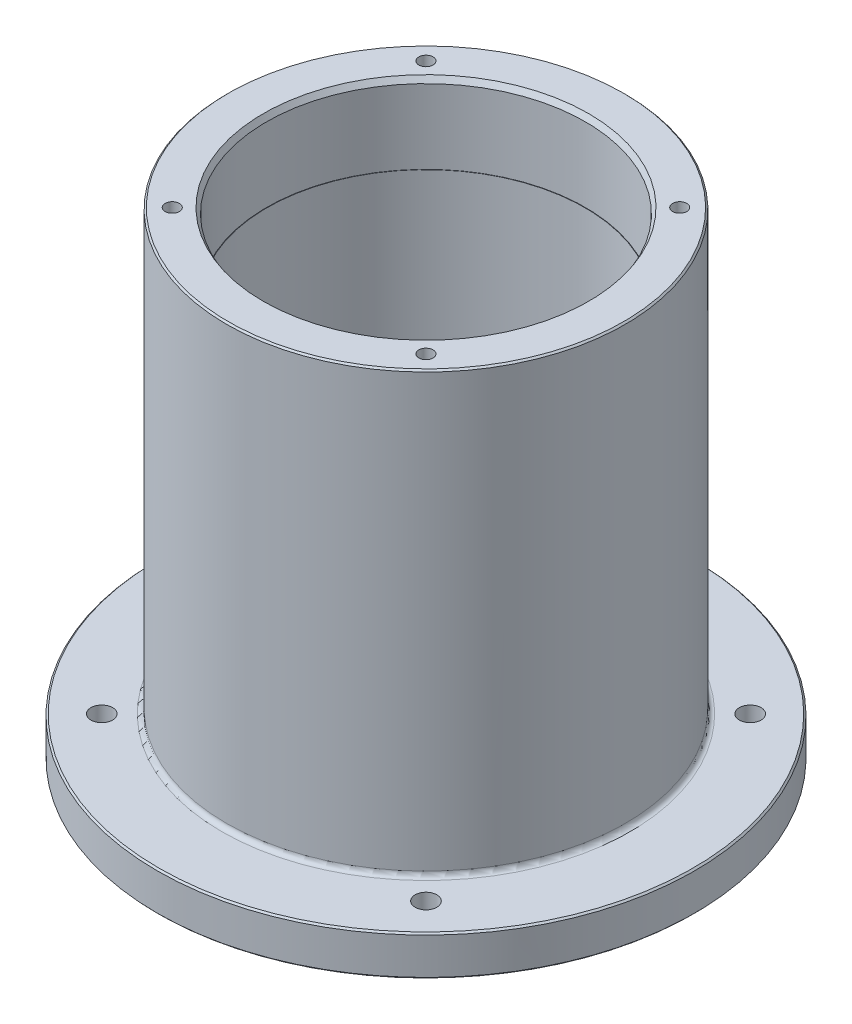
ISO-10303-21;
HEADER;
FILE_DESCRIPTION(('STEP AP214'),'2;1');
FILE_NAME('part.step','',(''),(''),'','','');
FILE_SCHEMA(('AUTOMOTIVE_DESIGN { 1 0 10303 214 1 1 1 1 }'));
ENDSEC;
DATA;
#1=APPLICATION_CONTEXT('core data for automotive mechanical design processes');
#2=APPLICATION_PROTOCOL_DEFINITION('international standard','automotive_design',2000,#1);
#3=PRODUCT_CONTEXT('',#1,'mechanical');
#4=PRODUCT('Part','Part','',(#3));
#5=PRODUCT_RELATED_PRODUCT_CATEGORY('part','',(#4));
#6=PRODUCT_DEFINITION_FORMATION('','',#4);
#7=PRODUCT_DEFINITION_CONTEXT('part definition',#1,'design');
#8=PRODUCT_DEFINITION('design','',#6,#7);
#9=PRODUCT_DEFINITION_SHAPE('','',#8);
#10=(LENGTH_UNIT() NAMED_UNIT(*) SI_UNIT(.MILLI.,.METRE.));
#11=(NAMED_UNIT(*) PLANE_ANGLE_UNIT() SI_UNIT($,.RADIAN.));
#12=(NAMED_UNIT(*) SI_UNIT($,.STERADIAN.) SOLID_ANGLE_UNIT());
#13=UNCERTAINTY_MEASURE_WITH_UNIT(LENGTH_MEASURE(1.E-05),#10,'distance_accuracy_value','');
#14=(GEOMETRIC_REPRESENTATION_CONTEXT(3) GLOBAL_UNCERTAINTY_ASSIGNED_CONTEXT((#13)) GLOBAL_UNIT_ASSIGNED_CONTEXT((#10,
#11,#12)) REPRESENTATION_CONTEXT('',''));
#15=CARTESIAN_POINT('',(0.,0.,0.));
#16=DIRECTION('',(0.,0.,1.));
#17=DIRECTION('',(1.,0.,0.));
#18=AXIS2_PLACEMENT_3D('',#15,#16,#17);
#19=CARTESIAN_POINT('',(0.,-101.6,0.));
#20=DIRECTION('',(0.,1.,0.));
#21=DIRECTION('',(0.,0.,1.));
#22=AXIS2_PLACEMENT_3D('',#19,#20,#21);
#23=CYLINDRICAL_SURFACE('',#22,42.799);
#24=CARTESIAN_POINT('',(0.,-85.979,0.));
#25=DIRECTION('',(0.,1.,0.));
#26=DIRECTION('',(0.,0.,1.));
#27=AXIS2_PLACEMENT_3D('',#24,#25,#26);
#28=CIRCLE('',#27,42.799);
#29=CARTESIAN_POINT('',(0.,-85.979,42.799));
#30=VERTEX_POINT('',#29);
#31=EDGE_CURVE('E229',#30,#30,#28,.F.);
#32=ORIENTED_EDGE('',*,*,#31,.T.);
#33=EDGE_LOOP('',(#32));
#34=FACE_BOUND('',#33,.T.);
#35=CARTESIAN_POINT('',(0.,-91.821,0.));
#36=DIRECTION('',(0.,-1.,0.));
#37=DIRECTION('',(0.,0.,-1.));
#38=AXIS2_PLACEMENT_3D('',#35,#36,#37);
#39=CIRCLE('',#38,42.799);
#40=CARTESIAN_POINT('',(0.,-91.821,-42.799));
#41=VERTEX_POINT('',#40);
#42=EDGE_CURVE('E226',#41,#41,#39,.F.);
#43=ORIENTED_EDGE('',*,*,#42,.T.);
#44=EDGE_LOOP('',(#43));
#45=FACE_BOUND('',#44,.T.);
#46=ADVANCED_FACE('F37',(#34,#45),#23,.T.);
#47=CARTESIAN_POINT('',(41.275,-15.875,3.175));
#48=DIRECTION('',(0.,-1.,0.));
#49=DIRECTION('',(0.,0.,-1.));
#50=AXIS2_PLACEMENT_3D('',#47,#48,#49);
#51=PLANE('',#50);
#52=CARTESIAN_POINT('',(0.,-15.875,0.));
#53=DIRECTION('',(0.,-1.,0.));
#54=DIRECTION('',(0.,0.,-1.));
#55=AXIS2_PLACEMENT_3D('',#52,#53,#54);
#56=CIRCLE('',#55,25.9080000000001);
#57=CARTESIAN_POINT('',(0.,-15.875,25.9080000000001));
#58=VERTEX_POINT('',#57);
#59=EDGE_CURVE('E12',#58,#58,#56,.T.);
#60=ORIENTED_EDGE('',*,*,#59,.T.);
#61=EDGE_LOOP('',(#60));
#62=FACE_BOUND('',#61,.T.);
#63=CARTESIAN_POINT('',(-20.2055762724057,-15.875,-20.2055762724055));
#64=DIRECTION('',(0.,1.,0.));
#65=DIRECTION('',(0.,0.,1.));
#66=AXIS2_PLACEMENT_3D('',#63,#64,#65);
#67=CIRCLE('',#66,1.13029999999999);
#68=CARTESIAN_POINT('',(-20.2055762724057,-15.875,-19.0752762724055));
#69=VERTEX_POINT('',#68);
#70=EDGE_CURVE('E248',#69,#69,#67,.T.);
#71=ORIENTED_EDGE('',*,*,#70,.F.);
#72=EDGE_LOOP('',(#71));
#73=FACE_BOUND('',#72,.T.);
#74=CARTESIAN_POINT('',(-20.2055762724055,-15.875,20.2055762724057));
#75=DIRECTION('',(0.,1.,0.));
#76=DIRECTION('',(0.,0.,1.));
#77=AXIS2_PLACEMENT_3D('',#74,#75,#76);
#78=CIRCLE('',#77,1.13030000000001);
#79=CARTESIAN_POINT('',(-20.2055762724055,-15.875,21.3358762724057));
#80=VERTEX_POINT('',#79);
#81=EDGE_CURVE('E268',#80,#80,#78,.T.);
#82=ORIENTED_EDGE('',*,*,#81,.F.);
#83=EDGE_LOOP('',(#82));
#84=FACE_BOUND('',#83,.T.);
#85=CARTESIAN_POINT('',(20.2055762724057,-15.875,20.2055762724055));
#86=DIRECTION('',(0.,1.,0.));
#87=DIRECTION('',(0.,0.,1.));
#88=AXIS2_PLACEMENT_3D('',#85,#86,#87);
#89=CIRCLE('',#88,1.13030000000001);
#90=CARTESIAN_POINT('',(20.2055762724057,-15.875,21.3358762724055));
#91=VERTEX_POINT('',#90);
#92=EDGE_CURVE('E272',#91,#91,#89,.T.);
#93=ORIENTED_EDGE('',*,*,#92,.F.);
#94=EDGE_LOOP('',(#93));
#95=FACE_BOUND('',#94,.T.);
#96=CARTESIAN_POINT('',(20.2055762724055,-15.875,-20.2055762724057));
#97=DIRECTION('',(0.,1.,0.));
#98=DIRECTION('',(0.,0.,1.));
#99=AXIS2_PLACEMENT_3D('',#96,#97,#98);
#100=CIRCLE('',#99,1.13029999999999);
#101=CARTESIAN_POINT('',(20.2055762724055,-15.875,-19.0752762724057));
#102=VERTEX_POINT('',#101);
#103=EDGE_CURVE('E276',#102,#102,#100,.T.);
#104=ORIENTED_EDGE('',*,*,#103,.F.);
#105=EDGE_LOOP('',(#104));
#106=FACE_BOUND('',#105,.T.);
#107=CARTESIAN_POINT('',(0.,-15.875,0.));
#108=DIRECTION('',(0.,-1.,0.));
#109=DIRECTION('',(0.,0.,-1.));
#110=AXIS2_PLACEMENT_3D('',#107,#108,#109);
#111=CIRCLE('',#110,31.496);
#112=CARTESIAN_POINT('',(0.,-15.875,-31.496));
#113=VERTEX_POINT('',#112);
#114=EDGE_CURVE('E220',#113,#113,#111,.F.);
#115=ORIENTED_EDGE('',*,*,#114,.T.);
#116=EDGE_LOOP('',(#115));
#117=FACE_BOUND('',#116,.T.);
#118=ADVANCED_FACE('F81',(#62,#73,#84,#95,#106,#117),#51,.F.);
#119=CARTESIAN_POINT('',(0.,-85.725,0.));
#120=DIRECTION('',(0.,1.,0.));
#121=DIRECTION('',(0.,0.,1.));
#122=AXIS2_PLACEMENT_3D('',#119,#120,#121);
#123=PLANE('',#122);
#124=CARTESIAN_POINT('',(0.,-85.725,0.));
#125=DIRECTION('',(0.,1.,0.));
#126=DIRECTION('',(0.,0.,1.));
#127=AXIS2_PLACEMENT_3D('',#124,#125,#126);
#128=CIRCLE('',#127,32.512);
#129=CARTESIAN_POINT('',(0.,-85.725,32.512));
#130=VERTEX_POINT('',#129);
#131=EDGE_CURVE('E243',#130,#130,#128,.F.);
#132=ORIENTED_EDGE('',*,*,#131,.T.);
#133=EDGE_LOOP('',(#132));
#134=FACE_BOUND('',#133,.T.);
#135=CARTESIAN_POINT('',(25.8182363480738,-85.725,-25.8182363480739));
#136=DIRECTION('',(0.,1.,0.));
#137=DIRECTION('',(0.,0.,1.));
#138=AXIS2_PLACEMENT_3D('',#135,#136,#137);
#139=CIRCLE('',#138,1.7272);
#140=CARTESIAN_POINT('',(25.8182363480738,-85.725,-24.0910363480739));
#141=VERTEX_POINT('',#140);
#142=EDGE_CURVE('E410',#141,#141,#139,.T.);
#143=ORIENTED_EDGE('',*,*,#142,.F.);
#144=EDGE_LOOP('',(#143));
#145=FACE_BOUND('',#144,.T.);
#146=CARTESIAN_POINT('',(-25.818236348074,-85.725,-25.8182363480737));
#147=DIRECTION('',(0.,1.,0.));
#148=DIRECTION('',(0.,0.,1.));
#149=AXIS2_PLACEMENT_3D('',#146,#147,#148);
#150=CIRCLE('',#149,1.72719999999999);
#151=CARTESIAN_POINT('',(-25.818236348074,-85.725,-24.0910363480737));
#152=VERTEX_POINT('',#151);
#153=EDGE_CURVE('E416',#152,#152,#150,.T.);
#154=ORIENTED_EDGE('',*,*,#153,.F.);
#155=EDGE_LOOP('',(#154));
#156=FACE_BOUND('',#155,.T.);
#157=CARTESIAN_POINT('',(-25.8182363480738,-85.725,25.8182363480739));
#158=DIRECTION('',(0.,1.,0.));
#159=DIRECTION('',(0.,0.,1.));
#160=AXIS2_PLACEMENT_3D('',#157,#158,#159);
#161=CIRCLE('',#160,1.72720000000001);
#162=CARTESIAN_POINT('',(-25.8182363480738,-85.725,27.5454363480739));
#163=VERTEX_POINT('',#162);
#164=EDGE_CURVE('E422',#163,#163,#161,.T.);
#165=ORIENTED_EDGE('',*,*,#164,.F.);
#166=EDGE_LOOP('',(#165));
#167=FACE_BOUND('',#166,.T.);
#168=CARTESIAN_POINT('',(25.818236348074,-85.725,25.8182363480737));
#169=DIRECTION('',(0.,1.,0.));
#170=DIRECTION('',(0.,0.,1.));
#171=AXIS2_PLACEMENT_3D('',#168,#169,#170);
#172=CIRCLE('',#171,1.7272);
#173=CARTESIAN_POINT('',(25.818236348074,-85.725,27.5454363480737));
#174=VERTEX_POINT('',#173);
#175=EDGE_CURVE('E428',#174,#174,#172,.T.);
#176=ORIENTED_EDGE('',*,*,#175,.F.);
#177=EDGE_LOOP('',(#176));
#178=FACE_BOUND('',#177,.T.);
#179=CARTESIAN_POINT('',(0.,-85.725,0.));
#180=DIRECTION('',(0.,1.,0.));
#181=DIRECTION('',(0.,0.,1.));
#182=AXIS2_PLACEMENT_3D('',#179,#180,#181);
#183=CIRCLE('',#182,42.545);
#184=CARTESIAN_POINT('',(0.,-85.725,42.545));
#185=VERTEX_POINT('',#184);
#186=EDGE_CURVE('E223',#185,#185,#183,.T.);
#187=ORIENTED_EDGE('',*,*,#186,.T.);
#188=EDGE_LOOP('',(#187));
#189=FACE_BOUND('',#188,.T.);
#190=ADVANCED_FACE('F87',(#134,#145,#156,#167,#178,#189),#123,.T.);
#191=CARTESIAN_POINT('',(0.,-85.725,0.));
#192=DIRECTION('',(0.,1.,0.));
#193=DIRECTION('',(0.,0.,1.));
#194=AXIS2_PLACEMENT_3D('',#191,#192,#193);
#195=CYLINDRICAL_SURFACE('',#194,31.75);
#196=CARTESIAN_POINT('',(0.,-84.963,0.));
#197=DIRECTION('',(0.,1.,0.));
#198=DIRECTION('',(0.,0.,1.));
#199=AXIS2_PLACEMENT_3D('',#196,#197,#198);
#200=CIRCLE('',#199,31.75);
#201=CARTESIAN_POINT('',(0.,-84.963,31.75));
#202=VERTEX_POINT('',#201);
#203=EDGE_CURVE('E240',#202,#202,#200,.T.);
#204=ORIENTED_EDGE('',*,*,#203,.T.);
#205=EDGE_LOOP('',(#204));
#206=FACE_BOUND('',#205,.T.);
#207=CARTESIAN_POINT('',(0.,-16.129,0.));
#208=DIRECTION('',(0.,-1.,0.));
#209=DIRECTION('',(0.,0.,-1.));
#210=AXIS2_PLACEMENT_3D('',#207,#208,#209);
#211=CIRCLE('',#210,31.75);
#212=CARTESIAN_POINT('',(0.,-16.129,-31.75));
#213=VERTEX_POINT('',#212);
#214=EDGE_CURVE('E207',#213,#213,#211,.T.);
#215=ORIENTED_EDGE('',*,*,#214,.T.);
#216=EDGE_LOOP('',(#215));
#217=FACE_BOUND('',#216,.T.);
#218=ADVANCED_FACE('F287',(#206,#217),#195,.T.);
#219=CARTESIAN_POINT('',(0.,-92.075,0.));
#220=DIRECTION('',(0.,-1.,0.));
#221=DIRECTION('',(0.,0.,-1.));
#222=AXIS2_PLACEMENT_3D('',#219,#220,#221);
#223=PLANE('',#222);
#224=CARTESIAN_POINT('',(25.8182363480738,-92.075,-25.8182363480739));
#225=DIRECTION('',(0.,-1.,0.));
#226=DIRECTION('',(0.,0.,-1.));
#227=AXIS2_PLACEMENT_3D('',#224,#225,#226);
#228=CIRCLE('',#227,1.7272);
#229=CARTESIAN_POINT('',(25.8182363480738,-92.075,-27.5454363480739));
#230=VERTEX_POINT('',#229);
#231=EDGE_CURVE('E406',#230,#230,#228,.T.);
#232=ORIENTED_EDGE('',*,*,#231,.F.);
#233=EDGE_LOOP('',(#232));
#234=FACE_BOUND('',#233,.T.);
#235=CARTESIAN_POINT('',(-25.818236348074,-92.075,-25.8182363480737));
#236=DIRECTION('',(0.,-1.,0.));
#237=DIRECTION('',(0.,0.,-1.));
#238=AXIS2_PLACEMENT_3D('',#235,#236,#237);
#239=CIRCLE('',#238,1.72719999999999);
#240=CARTESIAN_POINT('',(-25.818236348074,-92.075,-27.5454363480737));
#241=VERTEX_POINT('',#240);
#242=EDGE_CURVE('E413',#241,#241,#239,.T.);
#243=ORIENTED_EDGE('',*,*,#242,.F.);
#244=EDGE_LOOP('',(#243));
#245=FACE_BOUND('',#244,.T.);
#246=CARTESIAN_POINT('',(-25.8182363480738,-92.075,25.8182363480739));
#247=DIRECTION('',(0.,-1.,0.));
#248=DIRECTION('',(0.,0.,-1.));
#249=AXIS2_PLACEMENT_3D('',#246,#247,#248);
#250=CIRCLE('',#249,1.72720000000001);
#251=CARTESIAN_POINT('',(-25.8182363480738,-92.075,24.0910363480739));
#252=VERTEX_POINT('',#251);
#253=EDGE_CURVE('E419',#252,#252,#250,.T.);
#254=ORIENTED_EDGE('',*,*,#253,.F.);
#255=EDGE_LOOP('',(#254));
#256=FACE_BOUND('',#255,.T.);
#257=CARTESIAN_POINT('',(25.818236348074,-92.075,25.8182363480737));
#258=DIRECTION('',(0.,-1.,0.));
#259=DIRECTION('',(0.,0.,-1.));
#260=AXIS2_PLACEMENT_3D('',#257,#258,#259);
#261=CIRCLE('',#260,1.7272);
#262=CARTESIAN_POINT('',(25.818236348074,-92.075,24.0910363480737));
#263=VERTEX_POINT('',#262);
#264=EDGE_CURVE('E425',#263,#263,#261,.T.);
#265=ORIENTED_EDGE('',*,*,#264,.F.);
#266=EDGE_LOOP('',(#265));
#267=FACE_BOUND('',#266,.T.);
#268=CARTESIAN_POINT('',(0.,-92.075,0.));
#269=DIRECTION('',(0.,-1.,0.));
#270=DIRECTION('',(0.,0.,-1.));
#271=AXIS2_PLACEMENT_3D('',#268,#269,#270);
#272=CIRCLE('',#271,42.545);
#273=CARTESIAN_POINT('',(0.,-92.075,-42.545));
#274=VERTEX_POINT('',#273);
#275=EDGE_CURVE('E231',#274,#274,#272,.T.);
#276=ORIENTED_EDGE('',*,*,#275,.T.);
#277=EDGE_LOOP('',(#276));
#278=FACE_BOUND('',#277,.T.);
#279=CARTESIAN_POINT('',(0.,-92.075,0.));
#280=DIRECTION('',(0.,-1.,0.));
#281=DIRECTION('',(0.,0.,-1.));
#282=AXIS2_PLACEMENT_3D('',#279,#280,#281);
#283=CIRCLE('',#282,22.1996);
#284=CARTESIAN_POINT('',(0.,-92.075,-22.1996));
#285=VERTEX_POINT('',#284);
#286=EDGE_CURVE('E449',#285,#285,#283,.T.);
#287=ORIENTED_EDGE('',*,*,#286,.F.);
#288=EDGE_LOOP('',(#287));
#289=FACE_BOUND('',#288,.T.);
#290=ADVANCED_FACE('F289',(#234,#245,#256,#267,#278,#289),#223,.T.);
#291=CARTESIAN_POINT('',(0.,-92.075,0.));
#292=DIRECTION('',(0.,-1.,0.));
#293=DIRECTION('',(0.,0.,-1.));
#294=AXIS2_PLACEMENT_3D('',#291,#292,#293);
#295=CYLINDRICAL_SURFACE('',#294,22.1996);
#296=CARTESIAN_POINT('',(0.,-95.865593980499,0.));
#297=DIRECTION('',(0.,1.,0.));
#298=DIRECTION('',(0.,0.,1.));
#299=AXIS2_PLACEMENT_3D('',#296,#297,#298);
#300=CIRCLE('',#299,22.1996);
#301=CARTESIAN_POINT('',(0.,-95.865593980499,-22.1996));
#302=VERTEX_POINT('',#301);
#303=EDGE_CURVE('E440',#302,#302,#300,.T.);
#304=CARTESIAN_POINT('',(0.,-95.865593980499,-22.1996));
#305=CARTESIAN_POINT('',(0.,-95.8261086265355,-22.1996));
#306=CARTESIAN_POINT('',(0.,-95.7866232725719,-22.1996));
#307=CARTESIAN_POINT('',(0.,-95.7076525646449,-22.1996));
#308=CARTESIAN_POINT('',(0.,-95.6681672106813,-22.1996));
#309=CARTESIAN_POINT('',(0.,-95.5891965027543,-22.1996));
#310=CARTESIAN_POINT('',(0.,-95.5497111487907,-22.1996));
#311=CARTESIAN_POINT('',(0.,-95.4707404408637,-22.1996));
#312=CARTESIAN_POINT('',(0.,-95.4312550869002,-22.1996));
#313=CARTESIAN_POINT('',(0.,-95.3522843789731,-22.1996));
#314=CARTESIAN_POINT('',(0.,-95.3127990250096,-22.1996));
#315=CARTESIAN_POINT('',(0.,-95.2338283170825,-22.1996));
#316=CARTESIAN_POINT('',(0.,-95.194342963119,-22.1996));
#317=CARTESIAN_POINT('',(0.,-95.1153722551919,-22.1996));
#318=CARTESIAN_POINT('',(0.,-95.0758869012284,-22.1996));
#319=CARTESIAN_POINT('',(0.,-94.9969161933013,-22.1996));
#320=CARTESIAN_POINT('',(0.,-94.9574308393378,-22.1996));
#321=CARTESIAN_POINT('',(0.,-94.8784601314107,-22.1996));
#322=CARTESIAN_POINT('',(0.,-94.8389747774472,-22.1996));
#323=CARTESIAN_POINT('',(0.,-94.7600040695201,-22.1996));
#324=CARTESIAN_POINT('',(0.,-94.7205187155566,-22.1996));
#325=CARTESIAN_POINT('',(0.,-94.6415480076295,-22.1996));
#326=CARTESIAN_POINT('',(0.,-94.602062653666,-22.1996));
#327=CARTESIAN_POINT('',(0.,-94.5230919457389,-22.1996));
#328=CARTESIAN_POINT('',(0.,-94.4836065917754,-22.1996));
#329=CARTESIAN_POINT('',(0.,-94.4046358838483,-22.1996));
#330=CARTESIAN_POINT('',(0.,-94.3651505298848,-22.1996));
#331=CARTESIAN_POINT('',(0.,-94.2861798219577,-22.1996));
#332=CARTESIAN_POINT('',(0.,-94.2466944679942,-22.1996));
#333=CARTESIAN_POINT('',(0.,-94.1677237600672,-22.1996));
#334=CARTESIAN_POINT('',(0.,-94.1282384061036,-22.1996));
#335=CARTESIAN_POINT('',(0.,-94.0492676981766,-22.1996));
#336=CARTESIAN_POINT('',(0.,-94.009782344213,-22.1996));
#337=CARTESIAN_POINT('',(0.,-93.930811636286,-22.1996));
#338=CARTESIAN_POINT('',(0.,-93.8913262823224,-22.1996));
#339=CARTESIAN_POINT('',(0.,-93.8123555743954,-22.1996));
#340=CARTESIAN_POINT('',(0.,-93.7728702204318,-22.1996));
#341=CARTESIAN_POINT('',(0.,-93.6938995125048,-22.1996));
#342=CARTESIAN_POINT('',(0.,-93.6544141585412,-22.1996));
#343=CARTESIAN_POINT('',(0.,-93.5754434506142,-22.1996));
#344=CARTESIAN_POINT('',(0.,-93.5359580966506,-22.1996));
#345=CARTESIAN_POINT('',(0.,-93.4569873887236,-22.1996));
#346=CARTESIAN_POINT('',(0.,-93.4175020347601,-22.1996));
#347=CARTESIAN_POINT('',(0.,-93.338531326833,-22.1996));
#348=CARTESIAN_POINT('',(0.,-93.2990459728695,-22.1996));
#349=CARTESIAN_POINT('',(0.,-93.2200752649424,-22.1996));
#350=CARTESIAN_POINT('',(0.,-93.1805899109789,-22.1996));
#351=CARTESIAN_POINT('',(0.,-93.1016192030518,-22.1996));
#352=CARTESIAN_POINT('',(0.,-93.0621338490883,-22.1996));
#353=CARTESIAN_POINT('',(0.,-92.9831631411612,-22.1996));
#354=CARTESIAN_POINT('',(0.,-92.9436777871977,-22.1996));
#355=CARTESIAN_POINT('',(0.,-92.8647070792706,-22.1996));
#356=CARTESIAN_POINT('',(0.,-92.8252217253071,-22.1996));
#357=CARTESIAN_POINT('',(0.,-92.74625101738,-22.1996));
#358=CARTESIAN_POINT('',(0.,-92.7067656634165,-22.1996));
#359=CARTESIAN_POINT('',(0.,-92.6277949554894,-22.1996));
#360=CARTESIAN_POINT('',(0.,-92.5883096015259,-22.1996));
#361=CARTESIAN_POINT('',(0.,-92.5093388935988,-22.1996));
#362=CARTESIAN_POINT('',(0.,-92.4698535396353,-22.1996));
#363=CARTESIAN_POINT('',(0.,-92.3908828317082,-22.1996));
#364=CARTESIAN_POINT('',(0.,-92.3513974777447,-22.1996));
#365=CARTESIAN_POINT('',(0.,-92.2724267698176,-22.1996));
#366=CARTESIAN_POINT('',(0.,-92.2329414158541,-22.1996));
#367=CARTESIAN_POINT('',(0.,-92.1539707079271,-22.1996));
#368=CARTESIAN_POINT('',(0.,-92.1144853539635,-22.1996));
#369=CARTESIAN_POINT('',(0.,-92.075,-22.1996));
#370=B_SPLINE_CURVE_WITH_KNOTS('',3,(#304,#305,#306,#307,#308,#309,#310,#311,#312,#313,#314,
#315,#316,#317,#318,#319,#320,#321,#322,#323,#324,#325,#326,#327,#328,#329,#330,#331,#332,#333,
#334,#335,#336,#337,#338,#339,#340,#341,#342,#343,#344,#345,#346,#347,#348,#349,#350,#351,#352,
#353,#354,#355,#356,#357,#358,#359,#360,#361,#362,#363,#364,#365,#366,#367,#368,#369),
.UNSPECIFIED.,.F.,.F.,(4,2,2,2,2,2,2,2,2,2,2,2,2,2,2,2,2,2,2,2,2,2,2,2,2,2,2,2,2,2,2,2,4),(0.,
0.118456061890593,0.236912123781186,0.355368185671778,0.473824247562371,0.592280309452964,
0.710736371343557,0.829192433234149,0.947648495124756,1.06610455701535,1.18456061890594,
1.30301668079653,1.42147274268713,1.53992880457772,1.65838486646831,1.77684092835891,
1.89529699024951,2.01375305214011,2.1322091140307,2.25066517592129,2.36912123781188,
2.48757729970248,2.60603336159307,2.72448942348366,2.84294548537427,2.96140154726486,
3.07985760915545,3.19831367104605,3.31676973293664,3.43522579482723,3.55368185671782,
3.67213791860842,3.79059398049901),.UNSPECIFIED.);
#371=EDGE_CURVE('BSEAM283',#302,#285,#370,.T.);
#372=ORIENTED_EDGE('',*,*,#303,.T.);
#373=ORIENTED_EDGE('',*,*,#286,.T.);
#374=ORIENTED_EDGE('',*,*,#371,.T.);
#375=ORIENTED_EDGE('',*,*,#371,.F.);
#376=EDGE_LOOP('',(#372,#374,#373,#375));
#377=FACE_BOUND('',#376,.T.);
#378=ADVANCED_FACE('F283',(#377),#295,.T.);
#379=CARTESIAN_POINT('',(0.,-16.129,0.));
#380=DIRECTION('',(0.,-1.,0.));
#381=DIRECTION('',(0.,0.,-1.));
#382=AXIS2_PLACEMENT_3D('',#379,#380,#381);
#383=CONICAL_SURFACE('',#382,31.75,0.785398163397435);
#384=ORIENTED_EDGE('',*,*,#114,.F.);
#385=EDGE_LOOP('',(#384));
#386=FACE_BOUND('',#385,.T.);
#387=ORIENTED_EDGE('',*,*,#214,.F.);
#388=EDGE_LOOP('',(#387));
#389=FACE_BOUND('',#388,.T.);
#390=ADVANCED_FACE('F279',(#386,#389),#383,.T.);
#391=CARTESIAN_POINT('',(0.,-85.725,0.));
#392=DIRECTION('',(0.,-1.,0.));
#393=DIRECTION('',(0.,0.,-1.));
#394=AXIS2_PLACEMENT_3D('',#391,#392,#393);
#395=CONICAL_SURFACE('',#394,42.545,0.785398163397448);
#396=ORIENTED_EDGE('',*,*,#31,.F.);
#397=EDGE_LOOP('',(#396));
#398=FACE_BOUND('',#397,.T.);
#399=ORIENTED_EDGE('',*,*,#186,.F.);
#400=EDGE_LOOP('',(#399));
#401=FACE_BOUND('',#400,.T.);
#402=ADVANCED_FACE('F282',(#398,#401),#395,.T.);
#403=CARTESIAN_POINT('',(0.,-92.075,0.));
#404=DIRECTION('',(0.,1.,0.));
#405=DIRECTION('',(0.,0.,1.));
#406=AXIS2_PLACEMENT_3D('',#403,#404,#405);
#407=CONICAL_SURFACE('',#406,42.545,0.785398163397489);
#408=ORIENTED_EDGE('',*,*,#42,.F.);
#409=EDGE_LOOP('',(#408));
#410=FACE_BOUND('',#409,.T.);
#411=ORIENTED_EDGE('',*,*,#275,.F.);
#412=EDGE_LOOP('',(#411));
#413=FACE_BOUND('',#412,.T.);
#414=ADVANCED_FACE('F307',(#410,#413),#407,.T.);
#415=CARTESIAN_POINT('',(0.,-98.0733635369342,0.));
#416=DIRECTION('',(0.,1.,0.));
#417=DIRECTION('',(0.,0.,1.));
#418=AXIS2_PLACEMENT_3D('',#415,#416,#417);
#419=TOROIDAL_SURFACE('',#418,21.0947,0.253999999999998);
#420=CARTESIAN_POINT('',(0.,-98.0733635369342,0.));
#421=DIRECTION('',(0.,1.,0.));
#422=DIRECTION('',(0.,0.,1.));
#423=AXIS2_PLACEMENT_3D('',#420,#421,#422);
#424=CIRCLE('',#423,20.8407);
#425=CARTESIAN_POINT('',(0.,-98.0733635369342,20.8407));
#426=VERTEX_POINT('',#425);
#427=EDGE_CURVE('E431',#426,#426,#424,.T.);
#428=ORIENTED_EDGE('',*,*,#427,.F.);
#429=EDGE_LOOP('',(#428));
#430=FACE_BOUND('',#429,.T.);
#431=CARTESIAN_POINT('',(0.,-98.3263969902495,0.));
#432=DIRECTION('',(0.,1.,0.));
#433=DIRECTION('',(0.,0.,1.));
#434=AXIS2_PLACEMENT_3D('',#431,#432,#433);
#435=CIRCLE('',#434,21.0725624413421);
#436=CARTESIAN_POINT('',(0.,-98.3263969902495,21.0725624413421));
#437=VERTEX_POINT('',#436);
#438=EDGE_CURVE('E446',#437,#437,#435,.T.);
#439=ORIENTED_EDGE('',*,*,#438,.T.);
#440=EDGE_LOOP('',(#439));
#441=FACE_BOUND('',#440,.T.);
#442=ADVANCED_FACE('F303',(#430,#441),#419,.F.);
#443=CARTESIAN_POINT('',(0.,-98.425,0.));
#444=DIRECTION('',(0.,-1.,0.));
#445=DIRECTION('',(0.,0.,-1.));
#446=AXIS2_PLACEMENT_3D('',#443,#444,#445);
#447=CONICAL_SURFACE('',#446,22.1996,1.48352986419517);
#448=ORIENTED_EDGE('',*,*,#438,.F.);
#449=EDGE_LOOP('',(#448));
#450=FACE_BOUND('',#449,.T.);
#451=CARTESIAN_POINT('',(0.,-98.425,0.));
#452=DIRECTION('',(0.,1.,0.));
#453=DIRECTION('',(0.,0.,1.));
#454=AXIS2_PLACEMENT_3D('',#451,#452,#453);
#455=CIRCLE('',#454,22.1996);
#456=CARTESIAN_POINT('',(0.,-98.425,-22.1996));
#457=VERTEX_POINT('',#456);
#458=EDGE_CURVE('E443',#457,#457,#455,.T.);
#459=ORIENTED_EDGE('',*,*,#458,.T.);
#460=EDGE_LOOP('',(#459));
#461=FACE_BOUND('',#460,.T.);
#462=ADVANCED_FACE('F306',(#450,#461),#447,.T.);
#463=CARTESIAN_POINT('',(0.,-95.9641969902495,0.));
#464=DIRECTION('',(0.,1.,0.));
#465=DIRECTION('',(0.,0.,1.));
#466=AXIS2_PLACEMENT_3D('',#463,#464,#465);
#467=CONICAL_SURFACE('',#466,21.0725624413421,1.48352986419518);
#468=ORIENTED_EDGE('',*,*,#303,.F.);
#469=EDGE_LOOP('',(#468));
#470=FACE_BOUND('',#469,.T.);
#471=CARTESIAN_POINT('',(0.,-95.9641969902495,0.));
#472=DIRECTION('',(0.,1.,0.));
#473=DIRECTION('',(0.,0.,1.));
#474=AXIS2_PLACEMENT_3D('',#471,#472,#473);
#475=CIRCLE('',#474,21.0725624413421);
#476=CARTESIAN_POINT('',(0.,-95.9641969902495,21.0725624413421));
#477=VERTEX_POINT('',#476);
#478=EDGE_CURVE('E437',#477,#477,#475,.T.);
#479=ORIENTED_EDGE('',*,*,#478,.T.);
#480=EDGE_LOOP('',(#479));
#481=FACE_BOUND('',#480,.T.);
#482=ADVANCED_FACE('F311',(#470,#481),#467,.T.);
#483=CARTESIAN_POINT('',(0.,-96.2172304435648,0.));
#484=DIRECTION('',(0.,1.,0.));
#485=DIRECTION('',(0.,0.,1.));
#486=AXIS2_PLACEMENT_3D('',#483,#484,#485);
#487=TOROIDAL_SURFACE('',#486,21.0947,0.253999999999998);
#488=ORIENTED_EDGE('',*,*,#478,.F.);
#489=EDGE_LOOP('',(#488));
#490=FACE_BOUND('',#489,.T.);
#491=CARTESIAN_POINT('',(0.,-96.2172304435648,0.));
#492=DIRECTION('',(0.,1.,0.));
#493=DIRECTION('',(0.,0.,1.));
#494=AXIS2_PLACEMENT_3D('',#491,#492,#493);
#495=CIRCLE('',#494,20.8407);
#496=CARTESIAN_POINT('',(0.,-96.2172304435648,20.8407));
#497=VERTEX_POINT('',#496);
#498=EDGE_CURVE('E434',#497,#497,#495,.T.);
#499=ORIENTED_EDGE('',*,*,#498,.T.);
#500=EDGE_LOOP('',(#499));
#501=FACE_BOUND('',#500,.T.);
#502=ADVANCED_FACE('F315',(#490,#501),#487,.F.);
#503=CARTESIAN_POINT('',(0.,-142.0749,0.));
#504=DIRECTION('',(0.,1.,0.));
#505=DIRECTION('',(0.,0.,1.));
#506=AXIS2_PLACEMENT_3D('',#503,#504,#505);
#507=CYLINDRICAL_SURFACE('',#506,20.8407);
#508=ORIENTED_EDGE('',*,*,#498,.F.);
#509=EDGE_LOOP('',(#508));
#510=FACE_BOUND('',#509,.T.);
#511=ORIENTED_EDGE('',*,*,#427,.T.);
#512=EDGE_LOOP('',(#511));
#513=FACE_BOUND('',#512,.T.);
#514=ADVANCED_FACE('F99',(#510,#513),#507,.T.);
#515=CARTESIAN_POINT('',(0.,-73.025,0.));
#516=DIRECTION('',(0.,-1.,0.));
#517=DIRECTION('',(0.,0.,-1.));
#518=AXIS2_PLACEMENT_3D('',#515,#516,#517);
#519=PLANE('',#518);
#520=CARTESIAN_POINT('',(0.,-73.025,0.));
#521=DIRECTION('',(0.,-1.,0.));
#522=DIRECTION('',(0.,0.,-1.));
#523=AXIS2_PLACEMENT_3D('',#520,#521,#522);
#524=CIRCLE('',#523,2.5781);
#525=CARTESIAN_POINT('',(0.,-73.025,-2.5781));
#526=VERTEX_POINT('',#525);
#527=EDGE_CURVE('E453',#526,#526,#524,.T.);
#528=ORIENTED_EDGE('',*,*,#527,.T.);
#529=EDGE_LOOP('',(#528));
#530=FACE_BOUND('',#529,.T.);
#531=ADVANCED_FACE('F95',(#530),#519,.T.);
#532=CARTESIAN_POINT('',(0.,-73.025,0.));
#533=DIRECTION('',(0.,-1.,0.));
#534=DIRECTION('',(0.,0.,-1.));
#535=AXIS2_PLACEMENT_3D('',#532,#533,#534);
#536=CYLINDRICAL_SURFACE('',#535,2.5781);
#537=ORIENTED_EDGE('',*,*,#527,.F.);
#538=EDGE_LOOP('',(#537));
#539=FACE_BOUND('',#538,.T.);
#540=CARTESIAN_POINT('',(0.,-76.2,0.));
#541=DIRECTION('',(0.,-1.,0.));
#542=DIRECTION('',(0.,0.,-1.));
#543=AXIS2_PLACEMENT_3D('',#540,#541,#542);
#544=CIRCLE('',#543,2.5781);
#545=CARTESIAN_POINT('',(0.,-76.2,-2.5781));
#546=VERTEX_POINT('',#545);
#547=EDGE_CURVE('E452',#546,#546,#544,.T.);
#548=ORIENTED_EDGE('',*,*,#547,.T.);
#549=EDGE_LOOP('',(#548));
#550=FACE_BOUND('',#549,.T.);
#551=ADVANCED_FACE('F98',(#539,#550),#536,.F.);
#552=CARTESIAN_POINT('',(0.,-76.2,0.));
#553=DIRECTION('',(0.,-1.,0.));
#554=DIRECTION('',(0.,0.,-1.));
#555=AXIS2_PLACEMENT_3D('',#552,#553,#554);
#556=PLANE('',#555);
#557=ORIENTED_EDGE('',*,*,#547,.F.);
#558=EDGE_LOOP('',(#557));
#559=FACE_BOUND('',#558,.T.);
#560=CARTESIAN_POINT('',(0.,-76.2,0.));
#561=DIRECTION('',(0.,-1.,0.));
#562=DIRECTION('',(0.,0.,-1.));
#563=AXIS2_PLACEMENT_3D('',#560,#561,#562);
#564=CIRCLE('',#563,5.75437);
#565=CARTESIAN_POINT('',(0.,-76.2,-5.75437));
#566=VERTEX_POINT('',#565);
#567=EDGE_CURVE('E204',#566,#566,#564,.T.);
#568=ORIENTED_EDGE('',*,*,#567,.T.);
#569=EDGE_LOOP('',(#568));
#570=FACE_BOUND('',#569,.T.);
#571=ADVANCED_FACE('F74',(#559,#570),#556,.T.);
#572=CARTESIAN_POINT('',(0.,-76.2,0.));
#573=DIRECTION('',(0.,-1.,0.));
#574=DIRECTION('',(0.,0.,-1.));
#575=AXIS2_PLACEMENT_3D('',#572,#573,#574);
#576=CYLINDRICAL_SURFACE('',#575,5.75437);
#577=ORIENTED_EDGE('',*,*,#567,.F.);
#578=EDGE_LOOP('',(#577));
#579=FACE_BOUND('',#578,.T.);
#580=CARTESIAN_POINT('',(0.,-97.282,0.));
#581=DIRECTION('',(0.,-1.,0.));
#582=DIRECTION('',(0.,0.,-1.));
#583=AXIS2_PLACEMENT_3D('',#580,#581,#582);
#584=CIRCLE('',#583,5.75437);
#585=CARTESIAN_POINT('',(0.,-97.282,-5.75437));
#586=VERTEX_POINT('',#585);
#587=EDGE_CURVE('E194',#586,#586,#584,.F.);
#588=ORIENTED_EDGE('',*,*,#587,.F.);
#589=EDGE_LOOP('',(#588));
#590=FACE_BOUND('',#589,.T.);
#591=ADVANCED_FACE('F64',(#579,#590),#576,.F.);
#592=CARTESIAN_POINT('',(-0.00351295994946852,-96.837504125,12.7));
#593=DIRECTION('',(0.,-1.,0.));
#594=DIRECTION('',(0.,0.,-1.));
#595=AXIS2_PLACEMENT_3D('',#592,#593,#594);
#596=CONICAL_SURFACE('',#595,0.,1.0297443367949);
#597=CARTESIAN_POINT('',(-0.00351295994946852,-97.6501973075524,12.7));
#598=DIRECTION('',(0.,-1.,0.));
#599=DIRECTION('',(0.,0.,-1.));
#600=AXIS2_PLACEMENT_3D('',#597,#598,#599);
#601=CIRCLE('',#600,1.3525488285);
#602=CARTESIAN_POINT('',(-0.00351295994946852,-97.6501973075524,11.3474511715));
#603=VERTEX_POINT('',#602);
#604=EDGE_CURVE('E166',#603,#603,#601,.T.);
#605=ORIENTED_EDGE('',*,*,#604,.T.);
#606=EDGE_LOOP('',(#605));
#607=FACE_BOUND('',#606,.T.);
#608=CARTESIAN_POINT('',(-0.00351295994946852,-96.837504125,12.7));
#609=VERTEX_POINT('',#608);
#610=VERTEX_LOOP('',#609);
#611=FACE_BOUND('',#610,.T.);
#612=ADVANCED_FACE('F61',(#607,#611),#596,.F.);
#613=CARTESIAN_POINT('',(0.0035129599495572,-96.837504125,-12.7));
#614=DIRECTION('',(0.,-1.,0.));
#615=DIRECTION('',(0.,0.,-1.));
#616=AXIS2_PLACEMENT_3D('',#613,#614,#615);
#617=CONICAL_SURFACE('',#616,0.,1.0297443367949);
#618=CARTESIAN_POINT('',(0.0035129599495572,-97.6501973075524,-12.7));
#619=DIRECTION('',(0.,-1.,0.));
#620=DIRECTION('',(0.,0.,-1.));
#621=AXIS2_PLACEMENT_3D('',#618,#619,#620);
#622=CIRCLE('',#621,1.3525488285);
#623=CARTESIAN_POINT('',(0.0035129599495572,-97.6501973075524,-14.0525488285));
#624=VERTEX_POINT('',#623);
#625=EDGE_CURVE('E181',#624,#624,#622,.T.);
#626=ORIENTED_EDGE('',*,*,#625,.T.);
#627=EDGE_LOOP('',(#626));
#628=FACE_BOUND('',#627,.T.);
#629=CARTESIAN_POINT('',(0.0035129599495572,-96.837504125,-12.7));
#630=VERTEX_POINT('',#629);
#631=VERTEX_LOOP('',#630);
#632=FACE_BOUND('',#631,.T.);
#633=ADVANCED_FACE('F63',(#628,#632),#617,.F.);
#634=CARTESIAN_POINT('',(0.,-97.282,0.));
#635=DIRECTION('',(0.,-1.,0.));
#636=DIRECTION('',(0.,0.,-1.));
#637=AXIS2_PLACEMENT_3D('',#634,#635,#636);
#638=PLANE('',#637);
#639=CARTESIAN_POINT('',(0.,-97.282,0.));
#640=DIRECTION('',(0.,-1.,0.));
#641=DIRECTION('',(0.,0.,-1.));
#642=AXIS2_PLACEMENT_3D('',#639,#640,#641);
#643=CIRCLE('',#642,7.9375);
#644=CARTESIAN_POINT('',(0.,-97.282,-7.9375));
#645=VERTEX_POINT('',#644);
#646=EDGE_CURVE('E191',#645,#645,#643,.T.);
#647=ORIENTED_EDGE('',*,*,#646,.T.);
#648=EDGE_LOOP('',(#647));
#649=FACE_BOUND('',#648,.T.);
#650=ORIENTED_EDGE('',*,*,#587,.T.);
#651=EDGE_LOOP('',(#650));
#652=FACE_BOUND('',#651,.T.);
#653=ADVANCED_FACE('F71',(#649,#652),#638,.T.);
#654=CARTESIAN_POINT('',(12.7,-96.837504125,0.00351295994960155));
#655=DIRECTION('',(0.,-1.,0.));
#656=DIRECTION('',(0.,0.,-1.));
#657=AXIS2_PLACEMENT_3D('',#654,#655,#656);
#658=CONICAL_SURFACE('',#657,0.,1.0297443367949);
#659=CARTESIAN_POINT('',(12.7,-97.6501973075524,0.00351295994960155));
#660=DIRECTION('',(0.,-1.,0.));
#661=DIRECTION('',(0.,0.,-1.));
#662=AXIS2_PLACEMENT_3D('',#659,#660,#661);
#663=CIRCLE('',#662,1.3525488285);
#664=CARTESIAN_POINT('',(12.7,-97.6501973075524,-1.34903586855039));
#665=VERTEX_POINT('',#664);
#666=EDGE_CURVE('E187',#665,#665,#663,.T.);
#667=ORIENTED_EDGE('',*,*,#666,.T.);
#668=EDGE_LOOP('',(#667));
#669=FACE_BOUND('',#668,.T.);
#670=CARTESIAN_POINT('',(12.7,-96.837504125,0.00351295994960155));
#671=VERTEX_POINT('',#670);
#672=VERTEX_LOOP('',#671);
#673=FACE_BOUND('',#672,.T.);
#674=ADVANCED_FACE('F158',(#669,#673),#658,.F.);
#675=CARTESIAN_POINT('',(-12.7,-96.837504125,-0.00351295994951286));
#676=DIRECTION('',(0.,-1.,0.));
#677=DIRECTION('',(0.,0.,-1.));
#678=AXIS2_PLACEMENT_3D('',#675,#676,#677);
#679=CONICAL_SURFACE('',#678,0.,1.0297443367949);
#680=CARTESIAN_POINT('',(-12.7,-97.6501973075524,-0.00351295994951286));
#681=DIRECTION('',(0.,-1.,0.));
#682=DIRECTION('',(0.,0.,-1.));
#683=AXIS2_PLACEMENT_3D('',#680,#681,#682);
#684=CIRCLE('',#683,1.3525488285);
#685=CARTESIAN_POINT('',(-12.7,-97.6501973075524,-1.35606178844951));
#686=VERTEX_POINT('',#685);
#687=EDGE_CURVE('E170',#686,#686,#684,.T.);
#688=ORIENTED_EDGE('',*,*,#687,.T.);
#689=EDGE_LOOP('',(#688));
#690=FACE_BOUND('',#689,.T.);
#691=CARTESIAN_POINT('',(-12.7,-96.837504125,-0.00351295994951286));
#692=VERTEX_POINT('',#691);
#693=VERTEX_LOOP('',#692);
#694=FACE_BOUND('',#693,.T.);
#695=ADVANCED_FACE('F149',(#690,#694),#679,.F.);
#696=CARTESIAN_POINT('',(-0.00351295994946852,-101.6,12.7));
#697=DIRECTION('',(0.,-1.,0.));
#698=DIRECTION('',(0.,0.,-1.));
#699=AXIS2_PLACEMENT_3D('',#696,#697,#698);
#700=CYLINDRICAL_SURFACE('',#699,1.3525488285);
#701=CARTESIAN_POINT('',(-0.00351295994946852,-101.6,12.7));
#702=DIRECTION('',(0.,-1.,0.));
#703=DIRECTION('',(0.,0.,-1.));
#704=AXIS2_PLACEMENT_3D('',#701,#702,#703);
#705=CIRCLE('',#704,1.3525488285);
#706=CARTESIAN_POINT('',(-0.00351295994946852,-101.6,11.3474511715));
#707=VERTEX_POINT('',#706);
#708=EDGE_CURVE('E164',#707,#707,#705,.T.);
#709=ORIENTED_EDGE('',*,*,#708,.T.);
#710=EDGE_LOOP('',(#709));
#711=FACE_BOUND('',#710,.T.);
#712=ORIENTED_EDGE('',*,*,#604,.F.);
#713=EDGE_LOOP('',(#712));
#714=FACE_BOUND('',#713,.T.);
#715=ADVANCED_FACE('F146',(#711,#714),#700,.F.);
#716=CARTESIAN_POINT('',(0.0035129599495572,-101.6,-12.7));
#717=DIRECTION('',(0.,-1.,0.));
#718=DIRECTION('',(0.,0.,-1.));
#719=AXIS2_PLACEMENT_3D('',#716,#717,#718);
#720=CYLINDRICAL_SURFACE('',#719,1.3525488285);
#721=CARTESIAN_POINT('',(0.0035129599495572,-101.6,-12.7));
#722=DIRECTION('',(0.,-1.,0.));
#723=DIRECTION('',(0.,0.,-1.));
#724=AXIS2_PLACEMENT_3D('',#721,#722,#723);
#725=CIRCLE('',#724,1.3525488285);
#726=CARTESIAN_POINT('',(0.0035129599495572,-101.6,-14.0525488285));
#727=VERTEX_POINT('',#726);
#728=EDGE_CURVE('E178',#727,#727,#725,.T.);
#729=ORIENTED_EDGE('',*,*,#728,.T.);
#730=EDGE_LOOP('',(#729));
#731=FACE_BOUND('',#730,.T.);
#732=ORIENTED_EDGE('',*,*,#625,.F.);
#733=EDGE_LOOP('',(#732));
#734=FACE_BOUND('',#733,.T.);
#735=ADVANCED_FACE('F148',(#731,#734),#720,.F.);
#736=CARTESIAN_POINT('',(0.,-97.282,0.));
#737=DIRECTION('',(0.,-1.,0.));
#738=DIRECTION('',(0.,0.,-1.));
#739=AXIS2_PLACEMENT_3D('',#736,#737,#738);
#740=CYLINDRICAL_SURFACE('',#739,7.9375);
#741=ORIENTED_EDGE('',*,*,#646,.F.);
#742=EDGE_LOOP('',(#741));
#743=FACE_BOUND('',#742,.T.);
#744=CARTESIAN_POINT('',(0.,-101.6,0.));
#745=DIRECTION('',(0.,-1.,0.));
#746=DIRECTION('',(0.,0.,-1.));
#747=AXIS2_PLACEMENT_3D('',#744,#745,#746);
#748=CIRCLE('',#747,7.9375);
#749=CARTESIAN_POINT('',(0.,-101.6,-7.9375));
#750=VERTEX_POINT('',#749);
#751=EDGE_CURVE('E190',#750,#750,#748,.T.);
#752=ORIENTED_EDGE('',*,*,#751,.T.);
#753=EDGE_LOOP('',(#752));
#754=FACE_BOUND('',#753,.T.);
#755=ADVANCED_FACE('F155',(#743,#754),#740,.F.);
#756=CARTESIAN_POINT('',(12.7,-101.6,0.00351295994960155));
#757=DIRECTION('',(0.,-1.,0.));
#758=DIRECTION('',(0.,0.,-1.));
#759=AXIS2_PLACEMENT_3D('',#756,#757,#758);
#760=CYLINDRICAL_SURFACE('',#759,1.3525488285);
#761=CARTESIAN_POINT('',(12.7,-101.6,0.00351295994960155));
#762=DIRECTION('',(0.,-1.,0.));
#763=DIRECTION('',(0.,0.,-1.));
#764=AXIS2_PLACEMENT_3D('',#761,#762,#763);
#765=CIRCLE('',#764,1.3525488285);
#766=CARTESIAN_POINT('',(12.7,-101.6,-1.3490358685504));
#767=VERTEX_POINT('',#766);
#768=EDGE_CURVE('E184',#767,#767,#765,.T.);
#769=ORIENTED_EDGE('',*,*,#768,.T.);
#770=EDGE_LOOP('',(#769));
#771=FACE_BOUND('',#770,.T.);
#772=ORIENTED_EDGE('',*,*,#666,.F.);
#773=EDGE_LOOP('',(#772));
#774=FACE_BOUND('',#773,.T.);
#775=ADVANCED_FACE('F665',(#771,#774),#760,.F.);
#776=CARTESIAN_POINT('',(-12.7,-101.6,-0.00351295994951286));
#777=DIRECTION('',(0.,-1.,0.));
#778=DIRECTION('',(0.,0.,-1.));
#779=AXIS2_PLACEMENT_3D('',#776,#777,#778);
#780=CYLINDRICAL_SURFACE('',#779,1.3525488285);
#781=CARTESIAN_POINT('',(-12.7,-101.6,-0.00351295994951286));
#782=DIRECTION('',(0.,-1.,0.));
#783=DIRECTION('',(0.,0.,-1.));
#784=AXIS2_PLACEMENT_3D('',#781,#782,#783);
#785=CIRCLE('',#784,1.3525488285);
#786=CARTESIAN_POINT('',(-12.7,-101.6,-1.35606178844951));
#787=VERTEX_POINT('',#786);
#788=EDGE_CURVE('E167',#787,#787,#785,.T.);
#789=ORIENTED_EDGE('',*,*,#788,.T.);
#790=EDGE_LOOP('',(#789));
#791=FACE_BOUND('',#790,.T.);
#792=ORIENTED_EDGE('',*,*,#687,.F.);
#793=EDGE_LOOP('',(#792));
#794=FACE_BOUND('',#793,.T.);
#795=ADVANCED_FACE('F508',(#791,#794),#780,.F.);
#796=CARTESIAN_POINT('',(0.,-101.6,0.));
#797=DIRECTION('',(0.,1.,0.));
#798=DIRECTION('',(0.,0.,1.));
#799=AXIS2_PLACEMENT_3D('',#796,#797,#798);
#800=PLANE('',#799);
#801=CARTESIAN_POINT('',(0.,-101.6,0.));
#802=DIRECTION('',(0.,1.,0.));
#803=DIRECTION('',(0.,0.,1.));
#804=AXIS2_PLACEMENT_3D('',#801,#802,#803);
#805=CIRCLE('',#804,21.9456);
#806=CARTESIAN_POINT('',(0.,-101.6,21.9456));
#807=VERTEX_POINT('',#806);
#808=EDGE_CURVE('E234',#807,#807,#805,.F.);
#809=ORIENTED_EDGE('',*,*,#808,.T.);
#810=EDGE_LOOP('',(#809));
#811=FACE_BOUND('',#810,.T.);
#812=ORIENTED_EDGE('',*,*,#788,.F.);
#813=EDGE_LOOP('',(#812));
#814=FACE_BOUND('',#813,.T.);
#815=ORIENTED_EDGE('',*,*,#768,.F.);
#816=EDGE_LOOP('',(#815));
#817=FACE_BOUND('',#816,.T.);
#818=ORIENTED_EDGE('',*,*,#751,.F.);
#819=EDGE_LOOP('',(#818));
#820=FACE_BOUND('',#819,.T.);
#821=ORIENTED_EDGE('',*,*,#728,.F.);
#822=EDGE_LOOP('',(#821));
#823=FACE_BOUND('',#822,.T.);
#824=ORIENTED_EDGE('',*,*,#708,.F.);
#825=EDGE_LOOP('',(#824));
#826=FACE_BOUND('',#825,.T.);
#827=ADVANCED_FACE('F505',(#811,#814,#817,#820,#823,#826),#800,.F.);
#828=CARTESIAN_POINT('',(0.,-101.6,0.));
#829=DIRECTION('',(0.,1.,0.));
#830=DIRECTION('',(0.,0.,1.));
#831=AXIS2_PLACEMENT_3D('',#828,#829,#830);
#832=CONICAL_SURFACE('',#831,21.9456,0.785398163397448);
#833=CARTESIAN_POINT('',(0.,-101.346,0.));
#834=DIRECTION('',(0.,1.,0.));
#835=DIRECTION('',(0.,0.,1.));
#836=AXIS2_PLACEMENT_3D('',#833,#834,#835);
#837=CIRCLE('',#836,22.1996);
#838=CARTESIAN_POINT('',(0.,-101.346,-22.1996));
#839=VERTEX_POINT('',#838);
#840=EDGE_CURVE('E237',#839,#839,#837,.T.);
#841=ORIENTED_EDGE('',*,*,#840,.F.);
#842=EDGE_LOOP('',(#841));
#843=FACE_BOUND('',#842,.T.);
#844=ORIENTED_EDGE('',*,*,#808,.F.);
#845=EDGE_LOOP('',(#844));
#846=FACE_BOUND('',#845,.T.);
#847=ADVANCED_FACE('F507',(#843,#846),#832,.T.);
#848=CARTESIAN_POINT('',(0.,-98.425,-22.1996));
#849=CARTESIAN_POINT('',(0.,-98.4554270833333,-22.1996));
#850=CARTESIAN_POINT('',(0.,-98.4858541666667,-22.1996));
#851=CARTESIAN_POINT('',(0.,-98.5467083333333,-22.1996));
#852=CARTESIAN_POINT('',(0.,-98.5771354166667,-22.1996));
#853=CARTESIAN_POINT('',(0.,-98.6379895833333,-22.1996));
#854=CARTESIAN_POINT('',(0.,-98.6684166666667,-22.1996));
#855=CARTESIAN_POINT('',(0.,-98.7292708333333,-22.1996));
#856=CARTESIAN_POINT('',(0.,-98.7596979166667,-22.1996));
#857=CARTESIAN_POINT('',(0.,-98.8205520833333,-22.1996));
#858=CARTESIAN_POINT('',(0.,-98.8509791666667,-22.1996));
#859=CARTESIAN_POINT('',(0.,-98.9118333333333,-22.1996));
#860=CARTESIAN_POINT('',(0.,-98.9422604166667,-22.1996));
#861=CARTESIAN_POINT('',(0.,-99.0031145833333,-22.1996));
#862=CARTESIAN_POINT('',(0.,-99.0335416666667,-22.1996));
#863=CARTESIAN_POINT('',(0.,-99.0943958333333,-22.1996));
#864=CARTESIAN_POINT('',(0.,-99.1248229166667,-22.1996));
#865=CARTESIAN_POINT('',(0.,-99.1856770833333,-22.1996));
#866=CARTESIAN_POINT('',(0.,-99.2161041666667,-22.1996));
#867=CARTESIAN_POINT('',(0.,-99.2769583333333,-22.1996));
#868=CARTESIAN_POINT('',(0.,-99.3073854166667,-22.1996));
#869=CARTESIAN_POINT('',(0.,-99.3682395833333,-22.1996));
#870=CARTESIAN_POINT('',(0.,-99.3986666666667,-22.1996));
#871=CARTESIAN_POINT('',(0.,-99.4595208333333,-22.1996));
#872=CARTESIAN_POINT('',(0.,-99.4899479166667,-22.1996));
#873=CARTESIAN_POINT('',(0.,-99.5508020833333,-22.1996));
#874=CARTESIAN_POINT('',(0.,-99.5812291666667,-22.1996));
#875=CARTESIAN_POINT('',(0.,-99.6420833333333,-22.1996));
#876=CARTESIAN_POINT('',(0.,-99.6725104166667,-22.1996));
#877=CARTESIAN_POINT('',(0.,-99.7333645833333,-22.1996));
#878=CARTESIAN_POINT('',(0.,-99.7637916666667,-22.1996));
#879=CARTESIAN_POINT('',(0.,-99.8246458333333,-22.1996));
#880=CARTESIAN_POINT('',(0.,-99.8550729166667,-22.1996));
#881=CARTESIAN_POINT('',(0.,-99.9159270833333,-22.1996));
#882=CARTESIAN_POINT('',(0.,-99.9463541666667,-22.1996));
#883=CARTESIAN_POINT('',(0.,-100.007208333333,-22.1996));
#884=CARTESIAN_POINT('',(0.,-100.037635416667,-22.1996));
#885=CARTESIAN_POINT('',(0.,-100.098489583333,-22.1996));
#886=CARTESIAN_POINT('',(0.,-100.128916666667,-22.1996));
#887=CARTESIAN_POINT('',(0.,-100.189770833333,-22.1996));
#888=CARTESIAN_POINT('',(0.,-100.220197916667,-22.1996));
#889=CARTESIAN_POINT('',(0.,-100.281052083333,-22.1996));
#890=CARTESIAN_POINT('',(0.,-100.311479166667,-22.1996));
#891=CARTESIAN_POINT('',(0.,-100.372333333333,-22.1996));
#892=CARTESIAN_POINT('',(0.,-100.402760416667,-22.1996));
#893=CARTESIAN_POINT('',(0.,-100.463614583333,-22.1996));
#894=CARTESIAN_POINT('',(0.,-100.494041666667,-22.1996));
#895=CARTESIAN_POINT('',(0.,-100.554895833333,-22.1996));
#896=CARTESIAN_POINT('',(0.,-100.585322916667,-22.1996));
#897=CARTESIAN_POINT('',(0.,-100.646177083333,-22.1996));
#898=CARTESIAN_POINT('',(0.,-100.676604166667,-22.1996));
#899=CARTESIAN_POINT('',(0.,-100.737458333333,-22.1996));
#900=CARTESIAN_POINT('',(0.,-100.767885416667,-22.1996));
#901=CARTESIAN_POINT('',(0.,-100.828739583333,-22.1996));
#902=CARTESIAN_POINT('',(0.,-100.859166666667,-22.1996));
#903=CARTESIAN_POINT('',(0.,-100.920020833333,-22.1996));
#904=CARTESIAN_POINT('',(0.,-100.950447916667,-22.1996));
#905=CARTESIAN_POINT('',(0.,-101.011302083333,-22.1996));
#906=CARTESIAN_POINT('',(0.,-101.041729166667,-22.1996));
#907=CARTESIAN_POINT('',(0.,-101.102583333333,-22.1996));
#908=CARTESIAN_POINT('',(0.,-101.133010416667,-22.1996));
#909=CARTESIAN_POINT('',(0.,-101.193864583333,-22.1996));
#910=CARTESIAN_POINT('',(0.,-101.224291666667,-22.1996));
#911=CARTESIAN_POINT('',(0.,-101.285145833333,-22.1996));
#912=CARTESIAN_POINT('',(0.,-101.315572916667,-22.1996));
#913=CARTESIAN_POINT('',(0.,-101.346,-22.1996));
#914=B_SPLINE_CURVE_WITH_KNOTS('',3,(#848,#849,#850,#851,#852,#853,#854,#855,#856,#857,#858,
#859,#860,#861,#862,#863,#864,#865,#866,#867,#868,#869,#870,#871,#872,#873,#874,#875,#876,#877,
#878,#879,#880,#881,#882,#883,#884,#885,#886,#887,#888,#889,#890,#891,#892,#893,#894,#895,#896,
#897,#898,#899,#900,#901,#902,#903,#904,#905,#906,#907,#908,#909,#910,#911,#912,#913),
.UNSPECIFIED.,.F.,.F.,(4,2,2,2,2,2,2,2,2,2,2,2,2,2,2,2,2,2,2,2,2,2,2,2,2,2,2,2,2,2,2,2,4),(0.,
0.0912812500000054,0.182562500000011,0.273843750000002,0.365125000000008,0.456406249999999,
0.547687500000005,0.63896875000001,0.730250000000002,0.821531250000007,0.912812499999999,
1.00409375,1.09537500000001,1.18665625,1.27793750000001,1.36921875,1.4605,1.55178125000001,
1.6430625,1.73434375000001,1.825625,1.91690625,2.00818750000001,2.09946875,2.19075000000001,
2.28203125,2.3733125,2.46459375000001,2.555875,2.64715625,2.7384375,2.82971875,
2.92100000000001),.UNSPECIFIED.);
#915=EDGE_CURVE('BSEAM302',#457,#839,#914,.T.);
#916=ORIENTED_EDGE('',*,*,#458,.F.);
#917=ORIENTED_EDGE('',*,*,#840,.T.);
#918=ORIENTED_EDGE('',*,*,#915,.T.);
#919=ORIENTED_EDGE('',*,*,#915,.F.);
#920=EDGE_LOOP('',(#916,#918,#917,#919));
#921=FACE_BOUND('',#920,.T.);
#922=ADVANCED_FACE('F302',(#921),#295,.T.);
#923=CARTESIAN_POINT('',(25.818236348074,9.52500000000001,25.8182363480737));
#924=DIRECTION('',(0.,-1.,0.));
#925=DIRECTION('',(0.,0.,-1.));
#926=AXIS2_PLACEMENT_3D('',#923,#924,#925);
#927=CYLINDRICAL_SURFACE('',#926,1.7272);
#928=ORIENTED_EDGE('',*,*,#175,.T.);
#929=EDGE_LOOP('',(#928));
#930=FACE_BOUND('',#929,.T.);
#931=ORIENTED_EDGE('',*,*,#264,.T.);
#932=EDGE_LOOP('',(#931));
#933=FACE_BOUND('',#932,.T.);
#934=ADVANCED_FACE('F323',(#930,#933),#927,.F.);
#935=CARTESIAN_POINT('',(-25.8182363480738,9.52500000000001,25.8182363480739));
#936=DIRECTION('',(0.,-1.,0.));
#937=DIRECTION('',(0.,0.,-1.));
#938=AXIS2_PLACEMENT_3D('',#935,#936,#937);
#939=CYLINDRICAL_SURFACE('',#938,1.72720000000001);
#940=ORIENTED_EDGE('',*,*,#164,.T.);
#941=EDGE_LOOP('',(#940));
#942=FACE_BOUND('',#941,.T.);
#943=ORIENTED_EDGE('',*,*,#253,.T.);
#944=EDGE_LOOP('',(#943));
#945=FACE_BOUND('',#944,.T.);
#946=ADVANCED_FACE('F326',(#942,#945),#939,.F.);
#947=CARTESIAN_POINT('',(-25.818236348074,9.52500000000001,-25.8182363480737));
#948=DIRECTION('',(0.,-1.,0.));
#949=DIRECTION('',(0.,0.,-1.));
#950=AXIS2_PLACEMENT_3D('',#947,#948,#949);
#951=CYLINDRICAL_SURFACE('',#950,1.72719999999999);
#952=ORIENTED_EDGE('',*,*,#153,.T.);
#953=EDGE_LOOP('',(#952));
#954=FACE_BOUND('',#953,.T.);
#955=ORIENTED_EDGE('',*,*,#242,.T.);
#956=EDGE_LOOP('',(#955));
#957=FACE_BOUND('',#956,.T.);
#958=ADVANCED_FACE('F330',(#954,#957),#951,.F.);
#959=CARTESIAN_POINT('',(25.8182363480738,9.52500000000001,-25.8182363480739));
#960=DIRECTION('',(0.,-1.,0.));
#961=DIRECTION('',(0.,0.,-1.));
#962=AXIS2_PLACEMENT_3D('',#959,#960,#961);
#963=CYLINDRICAL_SURFACE('',#962,1.7272);
#964=ORIENTED_EDGE('',*,*,#142,.T.);
#965=EDGE_LOOP('',(#964));
#966=FACE_BOUND('',#965,.T.);
#967=ORIENTED_EDGE('',*,*,#231,.T.);
#968=EDGE_LOOP('',(#967));
#969=FACE_BOUND('',#968,.T.);
#970=ADVANCED_FACE('F334',(#966,#969),#963,.F.);
#971=CARTESIAN_POINT('',(20.2055762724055,-34.925,-20.2055762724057));
#972=DIRECTION('',(0.,1.,0.));
#973=DIRECTION('',(0.,0.,1.));
#974=AXIS2_PLACEMENT_3D('',#971,#972,#973);
#975=CYLINDRICAL_SURFACE('',#974,1.13029999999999);
#976=CARTESIAN_POINT('',(20.2055762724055,-34.925,-20.2055762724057));
#977=DIRECTION('',(0.,1.,0.));
#978=DIRECTION('',(0.,0.,1.));
#979=AXIS2_PLACEMENT_3D('',#976,#977,#978);
#980=CIRCLE('',#979,1.13029999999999);
#981=CARTESIAN_POINT('',(20.2055762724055,-34.925,-19.0752762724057));
#982=VERTEX_POINT('',#981);
#983=EDGE_CURVE('E403',#982,#982,#980,.T.);
#984=CARTESIAN_POINT('',(20.2055762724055,-34.925,-19.0752762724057));
#985=CARTESIAN_POINT('',(20.2055762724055,-34.7265625,-19.0752762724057));
#986=CARTESIAN_POINT('',(20.2055762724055,-34.528125,-19.0752762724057));
#987=CARTESIAN_POINT('',(20.2055762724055,-34.13125,-19.0752762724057));
#988=CARTESIAN_POINT('',(20.2055762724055,-33.9328125,-19.0752762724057));
#989=CARTESIAN_POINT('',(20.2055762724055,-33.5359375,-19.0752762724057));
#990=CARTESIAN_POINT('',(20.2055762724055,-33.3375,-19.0752762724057));
#991=CARTESIAN_POINT('',(20.2055762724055,-32.940625,-19.0752762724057));
#992=CARTESIAN_POINT('',(20.2055762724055,-32.7421875,-19.0752762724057));
#993=CARTESIAN_POINT('',(20.2055762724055,-32.3453125,-19.0752762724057));
#994=CARTESIAN_POINT('',(20.2055762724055,-32.146875,-19.0752762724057));
#995=CARTESIAN_POINT('',(20.2055762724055,-31.75,-19.0752762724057));
#996=CARTESIAN_POINT('',(20.2055762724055,-31.5515625,-19.0752762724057));
#997=CARTESIAN_POINT('',(20.2055762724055,-31.1546875,-19.0752762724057));
#998=CARTESIAN_POINT('',(20.2055762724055,-30.95625,-19.0752762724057));
#999=CARTESIAN_POINT('',(20.2055762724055,-30.559375,-19.0752762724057));
#1000=CARTESIAN_POINT('',(20.2055762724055,-30.3609375,-19.0752762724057));
#1001=CARTESIAN_POINT('',(20.2055762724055,-29.9640625,-19.0752762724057));
#1002=CARTESIAN_POINT('',(20.2055762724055,-29.765625,-19.0752762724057));
#1003=CARTESIAN_POINT('',(20.2055762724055,-29.36875,-19.0752762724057));
#1004=CARTESIAN_POINT('',(20.2055762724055,-29.1703125,-19.0752762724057));
#1005=CARTESIAN_POINT('',(20.2055762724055,-28.7734375,-19.0752762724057));
#1006=CARTESIAN_POINT('',(20.2055762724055,-28.575,-19.0752762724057));
#1007=CARTESIAN_POINT('',(20.2055762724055,-28.178125,-19.0752762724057));
#1008=CARTESIAN_POINT('',(20.2055762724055,-27.9796875,-19.0752762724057));
#1009=CARTESIAN_POINT('',(20.2055762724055,-27.5828125,-19.0752762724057));
#1010=CARTESIAN_POINT('',(20.2055762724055,-27.384375,-19.0752762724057));
#1011=CARTESIAN_POINT('',(20.2055762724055,-26.9875,-19.0752762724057));
#1012=CARTESIAN_POINT('',(20.2055762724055,-26.7890625,-19.0752762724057));
#1013=CARTESIAN_POINT('',(20.2055762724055,-26.3921875,-19.0752762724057));
#1014=CARTESIAN_POINT('',(20.2055762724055,-26.19375,-19.0752762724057));
#1015=CARTESIAN_POINT('',(20.2055762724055,-25.796875,-19.0752762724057));
#1016=CARTESIAN_POINT('',(20.2055762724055,-25.5984375,-19.0752762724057));
#1017=CARTESIAN_POINT('',(20.2055762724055,-25.2015625,-19.0752762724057));
#1018=CARTESIAN_POINT('',(20.2055762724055,-25.003125,-19.0752762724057));
#1019=CARTESIAN_POINT('',(20.2055762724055,-24.60625,-19.0752762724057));
#1020=CARTESIAN_POINT('',(20.2055762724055,-24.4078125,-19.0752762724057));
#1021=CARTESIAN_POINT('',(20.2055762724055,-24.0109375,-19.0752762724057));
#1022=CARTESIAN_POINT('',(20.2055762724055,-23.8125,-19.0752762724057));
#1023=CARTESIAN_POINT('',(20.2055762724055,-23.415625,-19.0752762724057));
#1024=CARTESIAN_POINT('',(20.2055762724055,-23.2171875,-19.0752762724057));
#1025=CARTESIAN_POINT('',(20.2055762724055,-22.8203125,-19.0752762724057));
#1026=CARTESIAN_POINT('',(20.2055762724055,-22.621875,-19.0752762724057));
#1027=CARTESIAN_POINT('',(20.2055762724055,-22.225,-19.0752762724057));
#1028=CARTESIAN_POINT('',(20.2055762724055,-22.0265625,-19.0752762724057));
#1029=CARTESIAN_POINT('',(20.2055762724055,-21.6296875,-19.0752762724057));
#1030=CARTESIAN_POINT('',(20.2055762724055,-21.43125,-19.0752762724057));
#1031=CARTESIAN_POINT('',(20.2055762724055,-21.034375,-19.0752762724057));
#1032=CARTESIAN_POINT('',(20.2055762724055,-20.8359375,-19.0752762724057));
#1033=CARTESIAN_POINT('',(20.2055762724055,-20.4390625,-19.0752762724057));
#1034=CARTESIAN_POINT('',(20.2055762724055,-20.240625,-19.0752762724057));
#1035=CARTESIAN_POINT('',(20.2055762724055,-19.84375,-19.0752762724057));
#1036=CARTESIAN_POINT('',(20.2055762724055,-19.6453125,-19.0752762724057));
#1037=CARTESIAN_POINT('',(20.2055762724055,-19.2484375,-19.0752762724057));
#1038=CARTESIAN_POINT('',(20.2055762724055,-19.05,-19.0752762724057));
#1039=CARTESIAN_POINT('',(20.2055762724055,-18.653125,-19.0752762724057));
#1040=CARTESIAN_POINT('',(20.2055762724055,-18.4546875,-19.0752762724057));
#1041=CARTESIAN_POINT('',(20.2055762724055,-18.0578125,-19.0752762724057));
#1042=CARTESIAN_POINT('',(20.2055762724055,-17.859375,-19.0752762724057));
#1043=CARTESIAN_POINT('',(20.2055762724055,-17.4625,-19.0752762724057));
#1044=CARTESIAN_POINT('',(20.2055762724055,-17.2640625,-19.0752762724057));
#1045=CARTESIAN_POINT('',(20.2055762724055,-16.8671875,-19.0752762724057));
#1046=CARTESIAN_POINT('',(20.2055762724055,-16.66875,-19.0752762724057));
#1047=CARTESIAN_POINT('',(20.2055762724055,-16.271875,-19.0752762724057));
#1048=CARTESIAN_POINT('',(20.2055762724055,-16.0734375,-19.0752762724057));
#1049=CARTESIAN_POINT('',(20.2055762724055,-15.875,-19.0752762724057));
#1050=B_SPLINE_CURVE_WITH_KNOTS('',3,(#984,#985,#986,#987,#988,#989,#990,#991,#992,#993,#994,
#995,#996,#997,#998,#999,#1000,#1001,#1002,#1003,#1004,#1005,#1006,#1007,#1008,#1009,#1010,
#1011,#1012,#1013,#1014,#1015,#1016,#1017,#1018,#1019,#1020,#1021,#1022,#1023,#1024,#1025,#1026,
#1027,#1028,#1029,#1030,#1031,#1032,#1033,#1034,#1035,#1036,#1037,#1038,#1039,#1040,#1041,#1042,
#1043,#1044,#1045,#1046,#1047,#1048,#1049),.UNSPECIFIED.,.F.,.F.,(4,2,2,2,2,2,2,2,2,2,2,2,2,2,2,
2,2,2,2,2,2,2,2,2,2,2,2,2,2,2,2,2,4),(0.,0.5953125,1.190625,1.7859375,2.38125,2.9765625,
3.571875,4.1671875,4.7625,5.3578125,5.953125,6.5484375,7.14375,7.7390625,8.334375,8.9296875,
9.525,10.1203125,10.715625,11.3109375,11.90625,12.5015625,13.096875,13.6921875,14.2875,
14.8828125,15.478125,16.0734375,16.66875,17.2640625,17.859375,18.4546875,19.05),.UNSPECIFIED.);
#1051=EDGE_CURVE('BSEAM338',#982,#102,#1050,.T.);
#1052=ORIENTED_EDGE('',*,*,#983,.F.);
#1053=ORIENTED_EDGE('',*,*,#103,.T.);
#1054=ORIENTED_EDGE('',*,*,#1051,.T.);
#1055=ORIENTED_EDGE('',*,*,#1051,.F.);
#1056=EDGE_LOOP('',(#1052,#1054,#1053,#1055));
#1057=FACE_BOUND('',#1056,.T.);
#1058=ADVANCED_FACE('F338',(#1057),#975,.F.);
#1059=CARTESIAN_POINT('',(20.2055762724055,-34.925,-20.2055762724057));
#1060=DIRECTION('',(0.,1.,0.));
#1061=DIRECTION('',(0.,0.,1.));
#1062=AXIS2_PLACEMENT_3D('',#1059,#1060,#1061);
#1063=PLANE('',#1062);
#1064=ORIENTED_EDGE('',*,*,#983,.T.);
#1065=EDGE_LOOP('',(#1064));
#1066=FACE_BOUND('',#1065,.T.);
#1067=ADVANCED_FACE('F342',(#1066),#1063,.T.);
#1068=CARTESIAN_POINT('',(20.2055762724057,-34.925,20.2055762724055));
#1069=DIRECTION('',(0.,1.,0.));
#1070=DIRECTION('',(0.,0.,1.));
#1071=AXIS2_PLACEMENT_3D('',#1068,#1069,#1070);
#1072=CYLINDRICAL_SURFACE('',#1071,1.13030000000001);
#1073=CARTESIAN_POINT('',(20.2055762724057,-34.925,20.2055762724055));
#1074=DIRECTION('',(0.,1.,0.));
#1075=DIRECTION('',(0.,0.,1.));
#1076=AXIS2_PLACEMENT_3D('',#1073,#1074,#1075);
#1077=CIRCLE('',#1076,1.13030000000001);
#1078=CARTESIAN_POINT('',(20.2055762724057,-34.925,21.3358762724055));
#1079=VERTEX_POINT('',#1078);
#1080=EDGE_CURVE('E399',#1079,#1079,#1077,.T.);
#1081=CARTESIAN_POINT('',(20.2055762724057,-34.925,21.3358762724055));
#1082=CARTESIAN_POINT('',(20.2055762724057,-34.7265625,21.3358762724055));
#1083=CARTESIAN_POINT('',(20.2055762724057,-34.528125,21.3358762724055));
#1084=CARTESIAN_POINT('',(20.2055762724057,-34.13125,21.3358762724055));
#1085=CARTESIAN_POINT('',(20.2055762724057,-33.9328125,21.3358762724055));
#1086=CARTESIAN_POINT('',(20.2055762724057,-33.5359375,21.3358762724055));
#1087=CARTESIAN_POINT('',(20.2055762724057,-33.3375,21.3358762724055));
#1088=CARTESIAN_POINT('',(20.2055762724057,-32.940625,21.3358762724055));
#1089=CARTESIAN_POINT('',(20.2055762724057,-32.7421875,21.3358762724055));
#1090=CARTESIAN_POINT('',(20.2055762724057,-32.3453125,21.3358762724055));
#1091=CARTESIAN_POINT('',(20.2055762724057,-32.146875,21.3358762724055));
#1092=CARTESIAN_POINT('',(20.2055762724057,-31.75,21.3358762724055));
#1093=CARTESIAN_POINT('',(20.2055762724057,-31.5515625,21.3358762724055));
#1094=CARTESIAN_POINT('',(20.2055762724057,-31.1546875,21.3358762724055));
#1095=CARTESIAN_POINT('',(20.2055762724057,-30.95625,21.3358762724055));
#1096=CARTESIAN_POINT('',(20.2055762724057,-30.559375,21.3358762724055));
#1097=CARTESIAN_POINT('',(20.2055762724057,-30.3609375,21.3358762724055));
#1098=CARTESIAN_POINT('',(20.2055762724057,-29.9640625,21.3358762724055));
#1099=CARTESIAN_POINT('',(20.2055762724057,-29.765625,21.3358762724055));
#1100=CARTESIAN_POINT('',(20.2055762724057,-29.36875,21.3358762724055));
#1101=CARTESIAN_POINT('',(20.2055762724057,-29.1703125,21.3358762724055));
#1102=CARTESIAN_POINT('',(20.2055762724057,-28.7734375,21.3358762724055));
#1103=CARTESIAN_POINT('',(20.2055762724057,-28.575,21.3358762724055));
#1104=CARTESIAN_POINT('',(20.2055762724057,-28.178125,21.3358762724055));
#1105=CARTESIAN_POINT('',(20.2055762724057,-27.9796875,21.3358762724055));
#1106=CARTESIAN_POINT('',(20.2055762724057,-27.5828125,21.3358762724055));
#1107=CARTESIAN_POINT('',(20.2055762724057,-27.384375,21.3358762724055));
#1108=CARTESIAN_POINT('',(20.2055762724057,-26.9875,21.3358762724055));
#1109=CARTESIAN_POINT('',(20.2055762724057,-26.7890625,21.3358762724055));
#1110=CARTESIAN_POINT('',(20.2055762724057,-26.3921875,21.3358762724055));
#1111=CARTESIAN_POINT('',(20.2055762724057,-26.19375,21.3358762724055));
#1112=CARTESIAN_POINT('',(20.2055762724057,-25.796875,21.3358762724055));
#1113=CARTESIAN_POINT('',(20.2055762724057,-25.5984375,21.3358762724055));
#1114=CARTESIAN_POINT('',(20.2055762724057,-25.2015625,21.3358762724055));
#1115=CARTESIAN_POINT('',(20.2055762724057,-25.003125,21.3358762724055));
#1116=CARTESIAN_POINT('',(20.2055762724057,-24.60625,21.3358762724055));
#1117=CARTESIAN_POINT('',(20.2055762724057,-24.4078125,21.3358762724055));
#1118=CARTESIAN_POINT('',(20.2055762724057,-24.0109375,21.3358762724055));
#1119=CARTESIAN_POINT('',(20.2055762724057,-23.8125,21.3358762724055));
#1120=CARTESIAN_POINT('',(20.2055762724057,-23.415625,21.3358762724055));
#1121=CARTESIAN_POINT('',(20.2055762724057,-23.2171875,21.3358762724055));
#1122=CARTESIAN_POINT('',(20.2055762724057,-22.8203125,21.3358762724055));
#1123=CARTESIAN_POINT('',(20.2055762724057,-22.621875,21.3358762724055));
#1124=CARTESIAN_POINT('',(20.2055762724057,-22.225,21.3358762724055));
#1125=CARTESIAN_POINT('',(20.2055762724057,-22.0265625,21.3358762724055));
#1126=CARTESIAN_POINT('',(20.2055762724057,-21.6296875,21.3358762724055));
#1127=CARTESIAN_POINT('',(20.2055762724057,-21.43125,21.3358762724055));
#1128=CARTESIAN_POINT('',(20.2055762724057,-21.034375,21.3358762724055));
#1129=CARTESIAN_POINT('',(20.2055762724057,-20.8359375,21.3358762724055));
#1130=CARTESIAN_POINT('',(20.2055762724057,-20.4390625,21.3358762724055));
#1131=CARTESIAN_POINT('',(20.2055762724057,-20.240625,21.3358762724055));
#1132=CARTESIAN_POINT('',(20.2055762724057,-19.84375,21.3358762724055));
#1133=CARTESIAN_POINT('',(20.2055762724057,-19.6453125,21.3358762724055));
#1134=CARTESIAN_POINT('',(20.2055762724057,-19.2484375,21.3358762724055));
#1135=CARTESIAN_POINT('',(20.2055762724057,-19.05,21.3358762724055));
#1136=CARTESIAN_POINT('',(20.2055762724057,-18.653125,21.3358762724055));
#1137=CARTESIAN_POINT('',(20.2055762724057,-18.4546875,21.3358762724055));
#1138=CARTESIAN_POINT('',(20.2055762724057,-18.0578125,21.3358762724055));
#1139=CARTESIAN_POINT('',(20.2055762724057,-17.859375,21.3358762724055));
#1140=CARTESIAN_POINT('',(20.2055762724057,-17.4625,21.3358762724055));
#1141=CARTESIAN_POINT('',(20.2055762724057,-17.2640625,21.3358762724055));
#1142=CARTESIAN_POINT('',(20.2055762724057,-16.8671875,21.3358762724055));
#1143=CARTESIAN_POINT('',(20.2055762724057,-16.66875,21.3358762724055));
#1144=CARTESIAN_POINT('',(20.2055762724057,-16.271875,21.3358762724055));
#1145=CARTESIAN_POINT('',(20.2055762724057,-16.0734375,21.3358762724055));
#1146=CARTESIAN_POINT('',(20.2055762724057,-15.875,21.3358762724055));
#1147=B_SPLINE_CURVE_WITH_KNOTS('',3,(#1081,#1082,#1083,#1084,#1085,#1086,#1087,#1088,#1089,
#1090,#1091,#1092,#1093,#1094,#1095,#1096,#1097,#1098,#1099,#1100,#1101,#1102,#1103,#1104,#1105,
#1106,#1107,#1108,#1109,#1110,#1111,#1112,#1113,#1114,#1115,#1116,#1117,#1118,#1119,#1120,#1121,
#1122,#1123,#1124,#1125,#1126,#1127,#1128,#1129,#1130,#1131,#1132,#1133,#1134,#1135,#1136,#1137,
#1138,#1139,#1140,#1141,#1142,#1143,#1144,#1145,#1146),.UNSPECIFIED.,.F.,.F.,(4,2,2,2,2,2,2,2,2,
2,2,2,2,2,2,2,2,2,2,2,2,2,2,2,2,2,2,2,2,2,2,2,4),(0.,0.5953125,1.190625,1.7859375,2.38125,
2.9765625,3.571875,4.1671875,4.7625,5.3578125,5.953125,6.5484375,7.14375,7.7390625,8.334375,
8.9296875,9.525,10.1203125,10.715625,11.3109375,11.90625,12.5015625,13.096875,13.6921875,
14.2875,14.8828125,15.478125,16.0734375,16.66875,17.2640625,17.859375,18.4546875,19.05),.UNSPECIFIED.);
#1148=EDGE_CURVE('BSEAM346',#1079,#91,#1147,.T.);
#1149=ORIENTED_EDGE('',*,*,#1080,.F.);
#1150=ORIENTED_EDGE('',*,*,#92,.T.);
#1151=ORIENTED_EDGE('',*,*,#1148,.T.);
#1152=ORIENTED_EDGE('',*,*,#1148,.F.);
#1153=EDGE_LOOP('',(#1149,#1151,#1150,#1152));
#1154=FACE_BOUND('',#1153,.T.);
#1155=ADVANCED_FACE('F346',(#1154),#1072,.F.);
#1156=CARTESIAN_POINT('',(20.2055762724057,-34.925,20.2055762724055));
#1157=DIRECTION('',(0.,1.,0.));
#1158=DIRECTION('',(0.,0.,1.));
#1159=AXIS2_PLACEMENT_3D('',#1156,#1157,#1158);
#1160=PLANE('',#1159);
#1161=ORIENTED_EDGE('',*,*,#1080,.T.);
#1162=EDGE_LOOP('',(#1161));
#1163=FACE_BOUND('',#1162,.T.);
#1164=ADVANCED_FACE('F350',(#1163),#1160,.T.);
#1165=CARTESIAN_POINT('',(-20.2055762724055,-34.925,20.2055762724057));
#1166=DIRECTION('',(0.,1.,0.));
#1167=DIRECTION('',(0.,0.,1.));
#1168=AXIS2_PLACEMENT_3D('',#1165,#1166,#1167);
#1169=CYLINDRICAL_SURFACE('',#1168,1.13030000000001);
#1170=CARTESIAN_POINT('',(-20.2055762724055,-34.925,20.2055762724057));
#1171=DIRECTION('',(0.,1.,0.));
#1172=DIRECTION('',(0.,0.,1.));
#1173=AXIS2_PLACEMENT_3D('',#1170,#1171,#1172);
#1174=CIRCLE('',#1173,1.13030000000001);
#1175=CARTESIAN_POINT('',(-20.2055762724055,-34.925,21.3358762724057));
#1176=VERTEX_POINT('',#1175);
#1177=EDGE_CURVE('E395',#1176,#1176,#1174,.T.);
#1178=CARTESIAN_POINT('',(-20.2055762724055,-34.925,21.3358762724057));
#1179=CARTESIAN_POINT('',(-20.2055762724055,-34.7265625,21.3358762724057));
#1180=CARTESIAN_POINT('',(-20.2055762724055,-34.528125,21.3358762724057));
#1181=CARTESIAN_POINT('',(-20.2055762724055,-34.13125,21.3358762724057));
#1182=CARTESIAN_POINT('',(-20.2055762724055,-33.9328125,21.3358762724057));
#1183=CARTESIAN_POINT('',(-20.2055762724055,-33.5359375,21.3358762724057));
#1184=CARTESIAN_POINT('',(-20.2055762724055,-33.3375,21.3358762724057));
#1185=CARTESIAN_POINT('',(-20.2055762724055,-32.940625,21.3358762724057));
#1186=CARTESIAN_POINT('',(-20.2055762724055,-32.7421875,21.3358762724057));
#1187=CARTESIAN_POINT('',(-20.2055762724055,-32.3453125,21.3358762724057));
#1188=CARTESIAN_POINT('',(-20.2055762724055,-32.146875,21.3358762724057));
#1189=CARTESIAN_POINT('',(-20.2055762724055,-31.75,21.3358762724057));
#1190=CARTESIAN_POINT('',(-20.2055762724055,-31.5515625,21.3358762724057));
#1191=CARTESIAN_POINT('',(-20.2055762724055,-31.1546875,21.3358762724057));
#1192=CARTESIAN_POINT('',(-20.2055762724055,-30.95625,21.3358762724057));
#1193=CARTESIAN_POINT('',(-20.2055762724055,-30.559375,21.3358762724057));
#1194=CARTESIAN_POINT('',(-20.2055762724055,-30.3609375,21.3358762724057));
#1195=CARTESIAN_POINT('',(-20.2055762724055,-29.9640625,21.3358762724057));
#1196=CARTESIAN_POINT('',(-20.2055762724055,-29.765625,21.3358762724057));
#1197=CARTESIAN_POINT('',(-20.2055762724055,-29.36875,21.3358762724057));
#1198=CARTESIAN_POINT('',(-20.2055762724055,-29.1703125,21.3358762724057));
#1199=CARTESIAN_POINT('',(-20.2055762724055,-28.7734375,21.3358762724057));
#1200=CARTESIAN_POINT('',(-20.2055762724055,-28.575,21.3358762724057));
#1201=CARTESIAN_POINT('',(-20.2055762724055,-28.178125,21.3358762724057));
#1202=CARTESIAN_POINT('',(-20.2055762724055,-27.9796875,21.3358762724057));
#1203=CARTESIAN_POINT('',(-20.2055762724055,-27.5828125,21.3358762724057));
#1204=CARTESIAN_POINT('',(-20.2055762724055,-27.384375,21.3358762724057));
#1205=CARTESIAN_POINT('',(-20.2055762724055,-26.9875,21.3358762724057));
#1206=CARTESIAN_POINT('',(-20.2055762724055,-26.7890625,21.3358762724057));
#1207=CARTESIAN_POINT('',(-20.2055762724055,-26.3921875,21.3358762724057));
#1208=CARTESIAN_POINT('',(-20.2055762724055,-26.19375,21.3358762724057));
#1209=CARTESIAN_POINT('',(-20.2055762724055,-25.796875,21.3358762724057));
#1210=CARTESIAN_POINT('',(-20.2055762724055,-25.5984375,21.3358762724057));
#1211=CARTESIAN_POINT('',(-20.2055762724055,-25.2015625,21.3358762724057));
#1212=CARTESIAN_POINT('',(-20.2055762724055,-25.003125,21.3358762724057));
#1213=CARTESIAN_POINT('',(-20.2055762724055,-24.60625,21.3358762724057));
#1214=CARTESIAN_POINT('',(-20.2055762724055,-24.4078125,21.3358762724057));
#1215=CARTESIAN_POINT('',(-20.2055762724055,-24.0109375,21.3358762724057));
#1216=CARTESIAN_POINT('',(-20.2055762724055,-23.8125,21.3358762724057));
#1217=CARTESIAN_POINT('',(-20.2055762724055,-23.415625,21.3358762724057));
#1218=CARTESIAN_POINT('',(-20.2055762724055,-23.2171875,21.3358762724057));
#1219=CARTESIAN_POINT('',(-20.2055762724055,-22.8203125,21.3358762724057));
#1220=CARTESIAN_POINT('',(-20.2055762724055,-22.621875,21.3358762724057));
#1221=CARTESIAN_POINT('',(-20.2055762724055,-22.225,21.3358762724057));
#1222=CARTESIAN_POINT('',(-20.2055762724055,-22.0265625,21.3358762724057));
#1223=CARTESIAN_POINT('',(-20.2055762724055,-21.6296875,21.3358762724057));
#1224=CARTESIAN_POINT('',(-20.2055762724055,-21.43125,21.3358762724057));
#1225=CARTESIAN_POINT('',(-20.2055762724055,-21.034375,21.3358762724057));
#1226=CARTESIAN_POINT('',(-20.2055762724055,-20.8359375,21.3358762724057));
#1227=CARTESIAN_POINT('',(-20.2055762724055,-20.4390625,21.3358762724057));
#1228=CARTESIAN_POINT('',(-20.2055762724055,-20.240625,21.3358762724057));
#1229=CARTESIAN_POINT('',(-20.2055762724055,-19.84375,21.3358762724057));
#1230=CARTESIAN_POINT('',(-20.2055762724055,-19.6453125,21.3358762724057));
#1231=CARTESIAN_POINT('',(-20.2055762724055,-19.2484375,21.3358762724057));
#1232=CARTESIAN_POINT('',(-20.2055762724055,-19.05,21.3358762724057));
#1233=CARTESIAN_POINT('',(-20.2055762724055,-18.653125,21.3358762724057));
#1234=CARTESIAN_POINT('',(-20.2055762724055,-18.4546875,21.3358762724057));
#1235=CARTESIAN_POINT('',(-20.2055762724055,-18.0578125,21.3358762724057));
#1236=CARTESIAN_POINT('',(-20.2055762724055,-17.859375,21.3358762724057));
#1237=CARTESIAN_POINT('',(-20.2055762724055,-17.4625,21.3358762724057));
#1238=CARTESIAN_POINT('',(-20.2055762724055,-17.2640625,21.3358762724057));
#1239=CARTESIAN_POINT('',(-20.2055762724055,-16.8671875,21.3358762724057));
#1240=CARTESIAN_POINT('',(-20.2055762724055,-16.66875,21.3358762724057));
#1241=CARTESIAN_POINT('',(-20.2055762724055,-16.271875,21.3358762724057));
#1242=CARTESIAN_POINT('',(-20.2055762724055,-16.0734375,21.3358762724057));
#1243=CARTESIAN_POINT('',(-20.2055762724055,-15.875,21.3358762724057));
#1244=B_SPLINE_CURVE_WITH_KNOTS('',3,(#1178,#1179,#1180,#1181,#1182,#1183,#1184,#1185,#1186,
#1187,#1188,#1189,#1190,#1191,#1192,#1193,#1194,#1195,#1196,#1197,#1198,#1199,#1200,#1201,#1202,
#1203,#1204,#1205,#1206,#1207,#1208,#1209,#1210,#1211,#1212,#1213,#1214,#1215,#1216,#1217,#1218,
#1219,#1220,#1221,#1222,#1223,#1224,#1225,#1226,#1227,#1228,#1229,#1230,#1231,#1232,#1233,#1234,
#1235,#1236,#1237,#1238,#1239,#1240,#1241,#1242,#1243),.UNSPECIFIED.,.F.,.F.,(4,2,2,2,2,2,2,2,2,
2,2,2,2,2,2,2,2,2,2,2,2,2,2,2,2,2,2,2,2,2,2,2,4),(0.,0.5953125,1.190625,1.7859375,2.38125,
2.9765625,3.571875,4.1671875,4.7625,5.3578125,5.953125,6.5484375,7.14375,7.7390625,8.334375,
8.9296875,9.525,10.1203125,10.715625,11.3109375,11.90625,12.5015625,13.096875,13.6921875,
14.2875,14.8828125,15.478125,16.0734375,16.66875,17.2640625,17.859375,18.4546875,19.05),.UNSPECIFIED.);
#1245=EDGE_CURVE('BSEAM354',#1176,#80,#1244,.T.);
#1246=ORIENTED_EDGE('',*,*,#1177,.F.);
#1247=ORIENTED_EDGE('',*,*,#81,.T.);
#1248=ORIENTED_EDGE('',*,*,#1245,.T.);
#1249=ORIENTED_EDGE('',*,*,#1245,.F.);
#1250=EDGE_LOOP('',(#1246,#1248,#1247,#1249));
#1251=FACE_BOUND('',#1250,.T.);
#1252=ADVANCED_FACE('F354',(#1251),#1169,.F.);
#1253=CARTESIAN_POINT('',(-20.2055762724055,-34.925,20.2055762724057));
#1254=DIRECTION('',(0.,1.,0.));
#1255=DIRECTION('',(0.,0.,1.));
#1256=AXIS2_PLACEMENT_3D('',#1253,#1254,#1255);
#1257=PLANE('',#1256);
#1258=ORIENTED_EDGE('',*,*,#1177,.T.);
#1259=EDGE_LOOP('',(#1258));
#1260=FACE_BOUND('',#1259,.T.);
#1261=ADVANCED_FACE('F358',(#1260),#1257,.T.);
#1262=CARTESIAN_POINT('',(-20.2055762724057,-34.925,-20.2055762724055));
#1263=DIRECTION('',(0.,1.,0.));
#1264=DIRECTION('',(0.,0.,1.));
#1265=AXIS2_PLACEMENT_3D('',#1262,#1263,#1264);
#1266=CYLINDRICAL_SURFACE('',#1265,1.13029999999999);
#1267=CARTESIAN_POINT('',(-20.2055762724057,-34.925,-20.2055762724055));
#1268=DIRECTION('',(0.,1.,0.));
#1269=DIRECTION('',(0.,0.,1.));
#1270=AXIS2_PLACEMENT_3D('',#1267,#1268,#1269);
#1271=CIRCLE('',#1270,1.13029999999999);
#1272=CARTESIAN_POINT('',(-20.2055762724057,-34.925,-19.0752762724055));
#1273=VERTEX_POINT('',#1272);
#1274=EDGE_CURVE('E391',#1273,#1273,#1271,.T.);
#1275=CARTESIAN_POINT('',(-20.2055762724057,-34.925,-19.0752762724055));
#1276=CARTESIAN_POINT('',(-20.2055762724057,-34.7265625,-19.0752762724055));
#1277=CARTESIAN_POINT('',(-20.2055762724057,-34.528125,-19.0752762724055));
#1278=CARTESIAN_POINT('',(-20.2055762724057,-34.13125,-19.0752762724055));
#1279=CARTESIAN_POINT('',(-20.2055762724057,-33.9328125,-19.0752762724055));
#1280=CARTESIAN_POINT('',(-20.2055762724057,-33.5359375,-19.0752762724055));
#1281=CARTESIAN_POINT('',(-20.2055762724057,-33.3375,-19.0752762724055));
#1282=CARTESIAN_POINT('',(-20.2055762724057,-32.940625,-19.0752762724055));
#1283=CARTESIAN_POINT('',(-20.2055762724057,-32.7421875,-19.0752762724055));
#1284=CARTESIAN_POINT('',(-20.2055762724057,-32.3453125,-19.0752762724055));
#1285=CARTESIAN_POINT('',(-20.2055762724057,-32.146875,-19.0752762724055));
#1286=CARTESIAN_POINT('',(-20.2055762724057,-31.75,-19.0752762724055));
#1287=CARTESIAN_POINT('',(-20.2055762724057,-31.5515625,-19.0752762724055));
#1288=CARTESIAN_POINT('',(-20.2055762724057,-31.1546875,-19.0752762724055));
#1289=CARTESIAN_POINT('',(-20.2055762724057,-30.95625,-19.0752762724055));
#1290=CARTESIAN_POINT('',(-20.2055762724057,-30.559375,-19.0752762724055));
#1291=CARTESIAN_POINT('',(-20.2055762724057,-30.3609375,-19.0752762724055));
#1292=CARTESIAN_POINT('',(-20.2055762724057,-29.9640625,-19.0752762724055));
#1293=CARTESIAN_POINT('',(-20.2055762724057,-29.765625,-19.0752762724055));
#1294=CARTESIAN_POINT('',(-20.2055762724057,-29.36875,-19.0752762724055));
#1295=CARTESIAN_POINT('',(-20.2055762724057,-29.1703125,-19.0752762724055));
#1296=CARTESIAN_POINT('',(-20.2055762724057,-28.7734375,-19.0752762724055));
#1297=CARTESIAN_POINT('',(-20.2055762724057,-28.575,-19.0752762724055));
#1298=CARTESIAN_POINT('',(-20.2055762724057,-28.178125,-19.0752762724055));
#1299=CARTESIAN_POINT('',(-20.2055762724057,-27.9796875,-19.0752762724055));
#1300=CARTESIAN_POINT('',(-20.2055762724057,-27.5828125,-19.0752762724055));
#1301=CARTESIAN_POINT('',(-20.2055762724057,-27.384375,-19.0752762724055));
#1302=CARTESIAN_POINT('',(-20.2055762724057,-26.9875,-19.0752762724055));
#1303=CARTESIAN_POINT('',(-20.2055762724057,-26.7890625,-19.0752762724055));
#1304=CARTESIAN_POINT('',(-20.2055762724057,-26.3921875,-19.0752762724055));
#1305=CARTESIAN_POINT('',(-20.2055762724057,-26.19375,-19.0752762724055));
#1306=CARTESIAN_POINT('',(-20.2055762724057,-25.796875,-19.0752762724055));
#1307=CARTESIAN_POINT('',(-20.2055762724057,-25.5984375,-19.0752762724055));
#1308=CARTESIAN_POINT('',(-20.2055762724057,-25.2015625,-19.0752762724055));
#1309=CARTESIAN_POINT('',(-20.2055762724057,-25.003125,-19.0752762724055));
#1310=CARTESIAN_POINT('',(-20.2055762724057,-24.60625,-19.0752762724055));
#1311=CARTESIAN_POINT('',(-20.2055762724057,-24.4078125,-19.0752762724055));
#1312=CARTESIAN_POINT('',(-20.2055762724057,-24.0109375,-19.0752762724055));
#1313=CARTESIAN_POINT('',(-20.2055762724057,-23.8125,-19.0752762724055));
#1314=CARTESIAN_POINT('',(-20.2055762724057,-23.415625,-19.0752762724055));
#1315=CARTESIAN_POINT('',(-20.2055762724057,-23.2171875,-19.0752762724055));
#1316=CARTESIAN_POINT('',(-20.2055762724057,-22.8203125,-19.0752762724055));
#1317=CARTESIAN_POINT('',(-20.2055762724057,-22.621875,-19.0752762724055));
#1318=CARTESIAN_POINT('',(-20.2055762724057,-22.225,-19.0752762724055));
#1319=CARTESIAN_POINT('',(-20.2055762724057,-22.0265625,-19.0752762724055));
#1320=CARTESIAN_POINT('',(-20.2055762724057,-21.6296875,-19.0752762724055));
#1321=CARTESIAN_POINT('',(-20.2055762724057,-21.43125,-19.0752762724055));
#1322=CARTESIAN_POINT('',(-20.2055762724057,-21.034375,-19.0752762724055));
#1323=CARTESIAN_POINT('',(-20.2055762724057,-20.8359375,-19.0752762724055));
#1324=CARTESIAN_POINT('',(-20.2055762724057,-20.4390625,-19.0752762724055));
#1325=CARTESIAN_POINT('',(-20.2055762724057,-20.240625,-19.0752762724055));
#1326=CARTESIAN_POINT('',(-20.2055762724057,-19.84375,-19.0752762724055));
#1327=CARTESIAN_POINT('',(-20.2055762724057,-19.6453125,-19.0752762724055));
#1328=CARTESIAN_POINT('',(-20.2055762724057,-19.2484375,-19.0752762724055));
#1329=CARTESIAN_POINT('',(-20.2055762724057,-19.05,-19.0752762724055));
#1330=CARTESIAN_POINT('',(-20.2055762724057,-18.653125,-19.0752762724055));
#1331=CARTESIAN_POINT('',(-20.2055762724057,-18.4546875,-19.0752762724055));
#1332=CARTESIAN_POINT('',(-20.2055762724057,-18.0578125,-19.0752762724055));
#1333=CARTESIAN_POINT('',(-20.2055762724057,-17.859375,-19.0752762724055));
#1334=CARTESIAN_POINT('',(-20.2055762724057,-17.4625,-19.0752762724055));
#1335=CARTESIAN_POINT('',(-20.2055762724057,-17.2640625,-19.0752762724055));
#1336=CARTESIAN_POINT('',(-20.2055762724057,-16.8671875,-19.0752762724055));
#1337=CARTESIAN_POINT('',(-20.2055762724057,-16.66875,-19.0752762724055));
#1338=CARTESIAN_POINT('',(-20.2055762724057,-16.271875,-19.0752762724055));
#1339=CARTESIAN_POINT('',(-20.2055762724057,-16.0734375,-19.0752762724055));
#1340=CARTESIAN_POINT('',(-20.2055762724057,-15.875,-19.0752762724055));
#1341=B_SPLINE_CURVE_WITH_KNOTS('',3,(#1275,#1276,#1277,#1278,#1279,#1280,#1281,#1282,#1283,
#1284,#1285,#1286,#1287,#1288,#1289,#1290,#1291,#1292,#1293,#1294,#1295,#1296,#1297,#1298,#1299,
#1300,#1301,#1302,#1303,#1304,#1305,#1306,#1307,#1308,#1309,#1310,#1311,#1312,#1313,#1314,#1315,
#1316,#1317,#1318,#1319,#1320,#1321,#1322,#1323,#1324,#1325,#1326,#1327,#1328,#1329,#1330,#1331,
#1332,#1333,#1334,#1335,#1336,#1337,#1338,#1339,#1340),.UNSPECIFIED.,.F.,.F.,(4,2,2,2,2,2,2,2,2,
2,2,2,2,2,2,2,2,2,2,2,2,2,2,2,2,2,2,2,2,2,2,2,4),(0.,0.5953125,1.190625,1.7859375,2.38125,
2.9765625,3.571875,4.1671875,4.7625,5.3578125,5.953125,6.5484375,7.14375,7.7390625,8.334375,
8.9296875,9.525,10.1203125,10.715625,11.3109375,11.90625,12.5015625,13.096875,13.6921875,
14.2875,14.8828125,15.478125,16.0734375,16.66875,17.2640625,17.859375,18.4546875,19.05),.UNSPECIFIED.);
#1342=EDGE_CURVE('BSEAM362',#1273,#69,#1341,.T.);
#1343=ORIENTED_EDGE('',*,*,#1274,.F.);
#1344=ORIENTED_EDGE('',*,*,#70,.T.);
#1345=ORIENTED_EDGE('',*,*,#1342,.T.);
#1346=ORIENTED_EDGE('',*,*,#1342,.F.);
#1347=EDGE_LOOP('',(#1343,#1345,#1344,#1346));
#1348=FACE_BOUND('',#1347,.T.);
#1349=ADVANCED_FACE('F362',(#1348),#1266,.F.);
#1350=CARTESIAN_POINT('',(-20.2055762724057,-34.925,-20.2055762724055));
#1351=DIRECTION('',(0.,1.,0.));
#1352=DIRECTION('',(0.,0.,1.));
#1353=AXIS2_PLACEMENT_3D('',#1350,#1351,#1352);
#1354=PLANE('',#1353);
#1355=ORIENTED_EDGE('',*,*,#1274,.T.);
#1356=EDGE_LOOP('',(#1355));
#1357=FACE_BOUND('',#1356,.T.);
#1358=ADVANCED_FACE('F366',(#1357),#1354,.T.);
#1359=CARTESIAN_POINT('',(0.,-84.963,0.));
#1360=DIRECTION('',(0.,1.,0.));
#1361=DIRECTION('',(0.,0.,1.));
#1362=AXIS2_PLACEMENT_3D('',#1359,#1360,#1361);
#1363=TOROIDAL_SURFACE('',#1362,32.512,0.762);
#1364=ORIENTED_EDGE('',*,*,#131,.F.);
#1365=EDGE_LOOP('',(#1364));
#1366=FACE_BOUND('',#1365,.T.);
#1367=ORIENTED_EDGE('',*,*,#203,.F.);
#1368=EDGE_LOOP('',(#1367));
#1369=FACE_BOUND('',#1368,.T.);
#1370=ADVANCED_FACE('F370',(#1366,#1369),#1363,.F.);
#1371=CARTESIAN_POINT('',(0.,-28.575,0.));
#1372=DIRECTION('',(0.,1.,0.));
#1373=DIRECTION('',(0.,0.,1.));
#1374=AXIS2_PLACEMENT_3D('',#1371,#1372,#1373);
#1375=CYLINDRICAL_SURFACE('',#1374,25.4);
#1376=CARTESIAN_POINT('',(0.,-16.7548818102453,0.));
#1377=DIRECTION('',(0.,-1.,0.));
#1378=DIRECTION('',(0.,0.,-1.));
#1379=AXIS2_PLACEMENT_3D('',#1376,#1377,#1378);
#1380=CIRCLE('',#1379,25.4);
#1381=CARTESIAN_POINT('',(0.,-16.7548818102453,25.4));
#1382=VERTEX_POINT('',#1381);
#1383=EDGE_CURVE('E45',#1382,#1382,#1380,.F.);
#1384=CARTESIAN_POINT('',(0.,-28.575,0.));
#1385=DIRECTION('',(0.,1.,0.));
#1386=DIRECTION('',(0.,0.,1.));
#1387=AXIS2_PLACEMENT_3D('',#1384,#1385,#1386);
#1388=CIRCLE('',#1387,25.4);
#1389=CARTESIAN_POINT('',(0.,-28.575,25.4));
#1390=VERTEX_POINT('',#1389);
#1391=EDGE_CURVE('E249',#1390,#1390,#1388,.T.);
#1392=CARTESIAN_POINT('',(0.,-16.7548818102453,25.4));
#1393=CARTESIAN_POINT('',(0.,-16.8780080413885,25.4));
#1394=CARTESIAN_POINT('',(0.,-17.0011342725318,25.4));
#1395=CARTESIAN_POINT('',(0.,-17.2473867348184,25.4));
#1396=CARTESIAN_POINT('',(0.,-17.3705129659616,25.4));
#1397=CARTESIAN_POINT('',(0.,-17.6167654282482,25.4));
#1398=CARTESIAN_POINT('',(0.,-17.7398916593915,25.4));
#1399=CARTESIAN_POINT('',(0.,-17.986144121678,25.4));
#1400=CARTESIAN_POINT('',(0.,-18.1092703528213,25.4));
#1401=CARTESIAN_POINT('',(0.,-18.3555228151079,25.4));
#1402=CARTESIAN_POINT('',(0.,-18.4786490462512,25.4));
#1403=CARTESIAN_POINT('',(0.,-18.7249015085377,25.4));
#1404=CARTESIAN_POINT('',(0.,-18.848027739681,25.4));
#1405=CARTESIAN_POINT('',(0.,-19.0942802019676,25.4));
#1406=CARTESIAN_POINT('',(0.,-19.2174064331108,25.4));
#1407=CARTESIAN_POINT('',(0.,-19.4636588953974,25.4));
#1408=CARTESIAN_POINT('',(0.,-19.5867851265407,25.4));
#1409=CARTESIAN_POINT('',(0.,-19.8330375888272,25.4));
#1410=CARTESIAN_POINT('',(0.,-19.9561638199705,25.4));
#1411=CARTESIAN_POINT('',(0.,-20.2024162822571,25.4));
#1412=CARTESIAN_POINT('',(0.,-20.3255425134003,25.4));
#1413=CARTESIAN_POINT('',(0.,-20.5717949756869,25.4));
#1414=CARTESIAN_POINT('',(0.,-20.6949212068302,25.4));
#1415=CARTESIAN_POINT('',(0.,-20.9411736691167,25.4));
#1416=CARTESIAN_POINT('',(0.,-21.06429990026,25.4));
#1417=CARTESIAN_POINT('',(0.,-21.3105523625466,25.4));
#1418=CARTESIAN_POINT('',(0.,-21.4336785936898,25.4));
#1419=CARTESIAN_POINT('',(0.,-21.6799310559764,25.4));
#1420=CARTESIAN_POINT('',(0.,-21.8030572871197,25.4));
#1421=CARTESIAN_POINT('',(0.,-22.0493097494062,25.4));
#1422=CARTESIAN_POINT('',(0.,-22.1724359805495,25.4));
#1423=CARTESIAN_POINT('',(0.,-22.4186884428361,25.4));
#1424=CARTESIAN_POINT('',(0.,-22.5418146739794,25.4));
#1425=CARTESIAN_POINT('',(0.,-22.7880671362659,25.4));
#1426=CARTESIAN_POINT('',(0.,-22.9111933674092,25.4));
#1427=CARTESIAN_POINT('',(0.,-23.1574458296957,25.4));
#1428=CARTESIAN_POINT('',(0.,-23.280572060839,25.4));
#1429=CARTESIAN_POINT('',(0.,-23.5268245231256,25.4));
#1430=CARTESIAN_POINT('',(0.,-23.6499507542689,25.4));
#1431=CARTESIAN_POINT('',(0.,-23.8962032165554,25.4));
#1432=CARTESIAN_POINT('',(0.,-24.0193294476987,25.4));
#1433=CARTESIAN_POINT('',(0.,-24.2655819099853,25.4));
#1434=CARTESIAN_POINT('',(0.,-24.3887081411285,25.4));
#1435=CARTESIAN_POINT('',(0.,-24.6349606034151,25.4));
#1436=CARTESIAN_POINT('',(0.,-24.7580868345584,25.4));
#1437=CARTESIAN_POINT('',(0.,-25.0043392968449,25.4));
#1438=CARTESIAN_POINT('',(0.,-25.1274655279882,25.4));
#1439=CARTESIAN_POINT('',(0.,-25.3737179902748,25.4));
#1440=CARTESIAN_POINT('',(0.,-25.496844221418,25.4));
#1441=CARTESIAN_POINT('',(0.,-25.7430966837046,25.4));
#1442=CARTESIAN_POINT('',(0.,-25.8662229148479,25.4));
#1443=CARTESIAN_POINT('',(0.,-26.1124753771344,25.4));
#1444=CARTESIAN_POINT('',(0.,-26.2356016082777,25.4));
#1445=CARTESIAN_POINT('',(0.,-26.4818540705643,25.4));
#1446=CARTESIAN_POINT('',(0.,-26.6049803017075,25.4));
#1447=CARTESIAN_POINT('',(0.,-26.8512327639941,25.4));
#1448=CARTESIAN_POINT('',(0.,-26.9743589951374,25.4));
#1449=CARTESIAN_POINT('',(0.,-27.2206114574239,25.4));
#1450=CARTESIAN_POINT('',(0.,-27.3437376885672,25.4));
#1451=CARTESIAN_POINT('',(0.,-27.5899901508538,25.4));
#1452=CARTESIAN_POINT('',(0.,-27.7131163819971,25.4));
#1453=CARTESIAN_POINT('',(0.,-27.9593688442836,25.4));
#1454=CARTESIAN_POINT('',(0.,-28.0824950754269,25.4));
#1455=CARTESIAN_POINT('',(0.,-28.3287475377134,25.4));
#1456=CARTESIAN_POINT('',(0.,-28.4518737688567,25.4));
#1457=CARTESIAN_POINT('',(0.,-28.575,25.4));
#1458=B_SPLINE_CURVE_WITH_KNOTS('',3,(#1392,#1393,#1394,#1395,#1396,#1397,#1398,#1399,#1400,
#1401,#1402,#1403,#1404,#1405,#1406,#1407,#1408,#1409,#1410,#1411,#1412,#1413,#1414,#1415,#1416,
#1417,#1418,#1419,#1420,#1421,#1422,#1423,#1424,#1425,#1426,#1427,#1428,#1429,#1430,#1431,#1432,
#1433,#1434,#1435,#1436,#1437,#1438,#1439,#1440,#1441,#1442,#1443,#1444,#1445,#1446,#1447,#1448,
#1449,#1450,#1451,#1452,#1453,#1454,#1455,#1456,#1457),.UNSPECIFIED.,.F.,.F.,(4,2,2,2,2,2,2,2,2,
2,2,2,2,2,2,2,2,2,2,2,2,2,2,2,2,2,2,2,2,2,2,2,4),(0.,0.369378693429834,0.738757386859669,
1.10813608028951,1.47751477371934,1.84689346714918,2.21627216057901,2.58565085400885,
2.95502954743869,3.32440824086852,3.69378693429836,4.06316562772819,4.43254432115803,
4.80192301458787,5.1713017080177,5.54068040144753,5.91005909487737,6.27943778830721,
6.64881648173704,7.01819517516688,7.38757386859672,7.75695256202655,8.12633125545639,
8.49570994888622,8.86508864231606,9.2344673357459,9.60384602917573,9.97322472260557,
10.3426034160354,10.7119821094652,11.0813608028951,11.4507394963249,11.8201181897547),.UNSPECIFIED.);
#1459=EDGE_CURVE('BSEAM253',#1382,#1390,#1458,.T.);
#1460=ORIENTED_EDGE('',*,*,#1383,.T.);
#1461=ORIENTED_EDGE('',*,*,#1391,.F.);
#1462=ORIENTED_EDGE('',*,*,#1459,.T.);
#1463=ORIENTED_EDGE('',*,*,#1459,.F.);
#1464=EDGE_LOOP('',(#1460,#1462,#1461,#1463));
#1465=FACE_BOUND('',#1464,.T.);
#1466=ADVANCED_FACE('F253',(#1465),#1375,.F.);
#1467=CARTESIAN_POINT('',(0.,-28.575,0.));
#1468=DIRECTION('',(0.,1.,0.));
#1469=DIRECTION('',(0.,0.,1.));
#1470=AXIS2_PLACEMENT_3D('',#1467,#1468,#1469);
#1471=PLANE('',#1470);
#1472=ORIENTED_EDGE('',*,*,#1391,.T.);
#1473=EDGE_LOOP('',(#1472));
#1474=FACE_BOUND('',#1473,.T.);
#1475=CARTESIAN_POINT('',(0.,-28.575,0.));
#1476=DIRECTION('',(0.,1.,0.));
#1477=DIRECTION('',(0.,0.,1.));
#1478=AXIS2_PLACEMENT_3D('',#1475,#1476,#1477);
#1479=CIRCLE('',#1478,25.3365);
#1480=CARTESIAN_POINT('',(0.,-28.575,25.3365));
#1481=VERTEX_POINT('',#1480);
#1482=EDGE_CURVE('E246',#1481,#1481,#1479,.F.);
#1483=ORIENTED_EDGE('',*,*,#1482,.T.);
#1484=EDGE_LOOP('',(#1483));
#1485=FACE_BOUND('',#1484,.T.);
#1486=ADVANCED_FACE('F374',(#1474,#1485),#1471,.T.);
#1487=CARTESIAN_POINT('',(0.,-69.8500000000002,0.));
#1488=DIRECTION('',(0.,1.,0.));
#1489=DIRECTION('',(0.,0.,1.));
#1490=AXIS2_PLACEMENT_3D('',#1487,#1488,#1489);
#1491=CONICAL_SURFACE('',#1490,2.63764717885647,1.02974425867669);
#1492=CARTESIAN_POINT('',(0.,-69.85,0.));
#1493=DIRECTION('',(0.,1.,0.));
#1494=DIRECTION('',(0.,0.,1.));
#1495=AXIS2_PLACEMENT_3D('',#1492,#1493,#1494);
#1496=CIRCLE('',#1495,2.63764717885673);
#1497=CARTESIAN_POINT('',(0.,-69.85,2.63764717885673));
#1498=VERTEX_POINT('',#1497);
#1499=EDGE_CURVE('E210',#1498,#1498,#1496,.T.);
#1500=ORIENTED_EDGE('',*,*,#1499,.T.);
#1501=EDGE_LOOP('',(#1500));
#1502=FACE_BOUND('',#1501,.T.);
#1503=CARTESIAN_POINT('',(0.,-71.4348583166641,0.));
#1504=VERTEX_POINT('',#1503);
#1505=VERTEX_LOOP('',#1504);
#1506=FACE_BOUND('',#1505,.T.);
#1507=ADVANCED_FACE('F376',(#1502,#1506),#1491,.F.);
#1508=CARTESIAN_POINT('',(0.,-69.85,0.));
#1509=DIRECTION('',(0.,1.,0.));
#1510=DIRECTION('',(0.,0.,1.));
#1511=AXIS2_PLACEMENT_3D('',#1508,#1509,#1510);
#1512=PLANE('',#1511);
#1513=ORIENTED_EDGE('',*,*,#1499,.F.);
#1514=EDGE_LOOP('',(#1513));
#1515=FACE_BOUND('',#1514,.T.);
#1516=CARTESIAN_POINT('',(0.,-69.85,0.));
#1517=DIRECTION('',(0.,1.,0.));
#1518=DIRECTION('',(0.,0.,1.));
#1519=AXIS2_PLACEMENT_3D('',#1516,#1517,#1518);
#1520=CIRCLE('',#1519,7.14375);
#1521=CARTESIAN_POINT('',(0.,-69.85,7.14375));
#1522=VERTEX_POINT('',#1521);
#1523=EDGE_CURVE('E201',#1522,#1522,#1520,.F.);
#1524=ORIENTED_EDGE('',*,*,#1523,.F.);
#1525=EDGE_LOOP('',(#1524));
#1526=FACE_BOUND('',#1525,.T.);
#1527=ADVANCED_FACE('F381',(#1515,#1526),#1512,.T.);
#1528=CARTESIAN_POINT('',(0.,-95.25,0.));
#1529=DIRECTION('',(0.,1.,0.));
#1530=DIRECTION('',(0.,0.,1.));
#1531=AXIS2_PLACEMENT_3D('',#1528,#1529,#1530);
#1532=CYLINDRICAL_SURFACE('',#1531,7.14375);
#1533=CARTESIAN_POINT('',(0.,-95.25,0.));
#1534=DIRECTION('',(0.,1.,0.));
#1535=DIRECTION('',(0.,0.,1.));
#1536=AXIS2_PLACEMENT_3D('',#1533,#1534,#1535);
#1537=CIRCLE('',#1536,7.14375);
#1538=CARTESIAN_POINT('',(0.,-95.25,7.14375));
#1539=VERTEX_POINT('',#1538);
#1540=EDGE_CURVE('E197',#1539,#1539,#1537,.T.);
#1541=ORIENTED_EDGE('',*,*,#1540,.T.);
#1542=EDGE_LOOP('',(#1541));
#1543=FACE_BOUND('',#1542,.T.);
#1544=ORIENTED_EDGE('',*,*,#1523,.T.);
#1545=EDGE_LOOP('',(#1544));
#1546=FACE_BOUND('',#1545,.T.);
#1547=ADVANCED_FACE('F108',(#1543,#1546),#1532,.T.);
#1548=CARTESIAN_POINT('',(-21.43125,-61.9125,0.));
#1549=DIRECTION('',(0.,-1.,0.));
#1550=DIRECTION('',(0.,0.,-1.));
#1551=AXIS2_PLACEMENT_3D('',#1548,#1549,#1550);
#1552=PLANE('',#1551);
#1553=CARTESIAN_POINT('',(-21.43125,-61.9125,0.));
#1554=DIRECTION('',(0.,-1.,0.));
#1555=DIRECTION('',(0.,0.,-1.));
#1556=AXIS2_PLACEMENT_3D('',#1553,#1554,#1555);
#1557=CIRCLE('',#1556,1.3462);
#1558=CARTESIAN_POINT('',(-21.43125,-61.9125,-1.3462));
#1559=VERTEX_POINT('',#1558);
#1560=EDGE_CURVE('E459',#1559,#1559,#1557,.T.);
#1561=ORIENTED_EDGE('',*,*,#1560,.F.);
#1562=EDGE_LOOP('',(#1561));
#1563=FACE_BOUND('',#1562,.T.);
#1564=ADVANCED_FACE('F104',(#1563),#1552,.F.);
#1565=CARTESIAN_POINT('',(21.43125,-61.9125,0.));
#1566=DIRECTION('',(0.,1.,0.));
#1567=DIRECTION('',(0.,0.,1.));
#1568=AXIS2_PLACEMENT_3D('',#1565,#1566,#1567);
#1569=PLANE('',#1568);
#1570=CARTESIAN_POINT('',(21.43125,-61.9125,0.));
#1571=DIRECTION('',(0.,1.,0.));
#1572=DIRECTION('',(0.,0.,1.));
#1573=AXIS2_PLACEMENT_3D('',#1570,#1571,#1572);
#1574=CIRCLE('',#1573,1.3462);
#1575=CARTESIAN_POINT('',(21.43125,-61.9125,1.3462));
#1576=VERTEX_POINT('',#1575);
#1577=EDGE_CURVE('E465',#1576,#1576,#1574,.T.);
#1578=ORIENTED_EDGE('',*,*,#1577,.T.);
#1579=EDGE_LOOP('',(#1578));
#1580=FACE_BOUND('',#1579,.T.);
#1581=ADVANCED_FACE('F107',(#1580),#1569,.T.);
#1582=CARTESIAN_POINT('',(0.,-95.25,0.));
#1583=DIRECTION('',(0.,1.,0.));
#1584=DIRECTION('',(0.,0.,1.));
#1585=AXIS2_PLACEMENT_3D('',#1582,#1583,#1584);
#1586=PLANE('',#1585);
#1587=ORIENTED_EDGE('',*,*,#1540,.F.);
#1588=EDGE_LOOP('',(#1587));
#1589=FACE_BOUND('',#1588,.T.);
#1590=CARTESIAN_POINT('',(0.,-95.25,0.));
#1591=DIRECTION('',(0.,1.,0.));
#1592=DIRECTION('',(0.,0.,1.));
#1593=AXIS2_PLACEMENT_3D('',#1590,#1591,#1592);
#1594=CIRCLE('',#1593,17.4625);
#1595=CARTESIAN_POINT('',(0.,-95.25,17.4625));
#1596=VERTEX_POINT('',#1595);
#1597=EDGE_CURVE('E200',#1596,#1596,#1594,.T.);
#1598=ORIENTED_EDGE('',*,*,#1597,.T.);
#1599=EDGE_LOOP('',(#1598));
#1600=FACE_BOUND('',#1599,.T.);
#1601=ADVANCED_FACE('F118',(#1589,#1600),#1586,.T.);
#1602=CARTESIAN_POINT('',(0.,-61.9125,-21.43125));
#1603=DIRECTION('',(0.,1.,0.));
#1604=DIRECTION('',(0.,0.,1.));
#1605=AXIS2_PLACEMENT_3D('',#1602,#1603,#1604);
#1606=PLANE('',#1605);
#1607=CARTESIAN_POINT('',(0.,-61.9125,-21.43125));
#1608=DIRECTION('',(0.,1.,0.));
#1609=DIRECTION('',(0.,0.,1.));
#1610=AXIS2_PLACEMENT_3D('',#1607,#1608,#1609);
#1611=CIRCLE('',#1610,1.3462);
#1612=CARTESIAN_POINT('',(0.,-61.9125,-20.08505));
#1613=VERTEX_POINT('',#1612);
#1614=EDGE_CURVE('E477',#1613,#1613,#1611,.T.);
#1615=ORIENTED_EDGE('',*,*,#1614,.T.);
#1616=EDGE_LOOP('',(#1615));
#1617=FACE_BOUND('',#1616,.T.);
#1618=ADVANCED_FACE('F126',(#1617),#1606,.T.);
#1619=CARTESIAN_POINT('',(0.,-61.9125,21.43125));
#1620=DIRECTION('',(0.,-1.,0.));
#1621=DIRECTION('',(0.,0.,-1.));
#1622=AXIS2_PLACEMENT_3D('',#1619,#1620,#1621);
#1623=PLANE('',#1622);
#1624=CARTESIAN_POINT('',(0.,-61.9125,21.43125));
#1625=DIRECTION('',(0.,-1.,0.));
#1626=DIRECTION('',(0.,0.,-1.));
#1627=AXIS2_PLACEMENT_3D('',#1624,#1625,#1626);
#1628=CIRCLE('',#1627,1.3462);
#1629=CARTESIAN_POINT('',(0.,-61.9125,20.08505));
#1630=VERTEX_POINT('',#1629);
#1631=EDGE_CURVE('E471',#1630,#1630,#1628,.T.);
#1632=ORIENTED_EDGE('',*,*,#1631,.F.);
#1633=EDGE_LOOP('',(#1632));
#1634=FACE_BOUND('',#1633,.T.);
#1635=ADVANCED_FACE('F114',(#1634),#1623,.F.);
#1636=CARTESIAN_POINT('',(-21.43125,-61.9125,0.));
#1637=DIRECTION('',(0.,1.,0.));
#1638=DIRECTION('',(0.,0.,1.));
#1639=AXIS2_PLACEMENT_3D('',#1636,#1637,#1638);
#1640=CYLINDRICAL_SURFACE('',#1639,1.3462);
#1641=ORIENTED_EDGE('',*,*,#1560,.T.);
#1642=EDGE_LOOP('',(#1641));
#1643=FACE_BOUND('',#1642,.T.);
#1644=CARTESIAN_POINT('',(-21.43125,-55.5625,0.));
#1645=DIRECTION('',(0.,-1.,0.));
#1646=DIRECTION('',(0.,0.,-1.));
#1647=AXIS2_PLACEMENT_3D('',#1644,#1645,#1646);
#1648=CIRCLE('',#1647,1.3462);
#1649=CARTESIAN_POINT('',(-21.43125,-55.5625,-1.3462));
#1650=VERTEX_POINT('',#1649);
#1651=EDGE_CURVE('E456',#1650,#1650,#1648,.T.);
#1652=ORIENTED_EDGE('',*,*,#1651,.F.);
#1653=EDGE_LOOP('',(#1652));
#1654=FACE_BOUND('',#1653,.T.);
#1655=ADVANCED_FACE('F110',(#1643,#1654),#1640,.F.);
#1656=CARTESIAN_POINT('',(21.43125,-61.9125,0.));
#1657=DIRECTION('',(0.,1.,0.));
#1658=DIRECTION('',(0.,0.,1.));
#1659=AXIS2_PLACEMENT_3D('',#1656,#1657,#1658);
#1660=CYLINDRICAL_SURFACE('',#1659,1.3462);
#1661=ORIENTED_EDGE('',*,*,#1577,.F.);
#1662=EDGE_LOOP('',(#1661));
#1663=FACE_BOUND('',#1662,.T.);
#1664=CARTESIAN_POINT('',(21.43125,-55.5625,0.));
#1665=DIRECTION('',(0.,1.,0.));
#1666=DIRECTION('',(0.,0.,1.));
#1667=AXIS2_PLACEMENT_3D('',#1664,#1665,#1666);
#1668=CIRCLE('',#1667,1.3462);
#1669=CARTESIAN_POINT('',(21.43125,-55.5625,1.3462));
#1670=VERTEX_POINT('',#1669);
#1671=EDGE_CURVE('E462',#1670,#1670,#1668,.T.);
#1672=ORIENTED_EDGE('',*,*,#1671,.T.);
#1673=EDGE_LOOP('',(#1672));
#1674=FACE_BOUND('',#1673,.T.);
#1675=ADVANCED_FACE('F113',(#1663,#1674),#1660,.F.);
#1676=CARTESIAN_POINT('',(0.,-95.25,0.));
#1677=DIRECTION('',(0.,1.,0.));
#1678=DIRECTION('',(0.,0.,1.));
#1679=AXIS2_PLACEMENT_3D('',#1676,#1677,#1678);
#1680=CYLINDRICAL_SURFACE('',#1679,17.4625);
#1681=ORIENTED_EDGE('',*,*,#1597,.F.);
#1682=EDGE_LOOP('',(#1681));
#1683=FACE_BOUND('',#1682,.T.);
#1684=CARTESIAN_POINT('',(0.,-55.5625,0.));
#1685=DIRECTION('',(0.,1.,0.));
#1686=DIRECTION('',(0.,0.,1.));
#1687=AXIS2_PLACEMENT_3D('',#1684,#1685,#1686);
#1688=CIRCLE('',#1687,17.4625);
#1689=CARTESIAN_POINT('',(0.,-55.5625,17.4625));
#1690=VERTEX_POINT('',#1689);
#1691=EDGE_CURVE('E172',#1690,#1690,#1688,.F.);
#1692=ORIENTED_EDGE('',*,*,#1691,.F.);
#1693=EDGE_LOOP('',(#1692));
#1694=FACE_BOUND('',#1693,.T.);
#1695=ADVANCED_FACE('F122',(#1683,#1694),#1680,.F.);
#1696=CARTESIAN_POINT('',(0.,-61.9125,-21.43125));
#1697=DIRECTION('',(0.,1.,0.));
#1698=DIRECTION('',(0.,0.,1.));
#1699=AXIS2_PLACEMENT_3D('',#1696,#1697,#1698);
#1700=CYLINDRICAL_SURFACE('',#1699,1.3462);
#1701=ORIENTED_EDGE('',*,*,#1614,.F.);
#1702=EDGE_LOOP('',(#1701));
#1703=FACE_BOUND('',#1702,.T.);
#1704=CARTESIAN_POINT('',(0.,-55.5625,-21.43125));
#1705=DIRECTION('',(0.,1.,0.));
#1706=DIRECTION('',(0.,0.,1.));
#1707=AXIS2_PLACEMENT_3D('',#1704,#1705,#1706);
#1708=CIRCLE('',#1707,1.3462);
#1709=CARTESIAN_POINT('',(0.,-55.5625,-20.08505));
#1710=VERTEX_POINT('',#1709);
#1711=EDGE_CURVE('E474',#1710,#1710,#1708,.T.);
#1712=ORIENTED_EDGE('',*,*,#1711,.T.);
#1713=EDGE_LOOP('',(#1712));
#1714=FACE_BOUND('',#1713,.T.);
#1715=ADVANCED_FACE('F132',(#1703,#1714),#1700,.F.);
#1716=CARTESIAN_POINT('',(0.,-61.9125,21.43125));
#1717=DIRECTION('',(0.,1.,0.));
#1718=DIRECTION('',(0.,0.,1.));
#1719=AXIS2_PLACEMENT_3D('',#1716,#1717,#1718);
#1720=CYLINDRICAL_SURFACE('',#1719,1.3462);
#1721=ORIENTED_EDGE('',*,*,#1631,.T.);
#1722=EDGE_LOOP('',(#1721));
#1723=FACE_BOUND('',#1722,.T.);
#1724=CARTESIAN_POINT('',(0.,-55.5625,21.43125));
#1725=DIRECTION('',(0.,-1.,0.));
#1726=DIRECTION('',(0.,0.,-1.));
#1727=AXIS2_PLACEMENT_3D('',#1724,#1725,#1726);
#1728=CIRCLE('',#1727,1.3462);
#1729=CARTESIAN_POINT('',(0.,-55.5625,20.08505));
#1730=VERTEX_POINT('',#1729);
#1731=EDGE_CURVE('E468',#1730,#1730,#1728,.T.);
#1732=ORIENTED_EDGE('',*,*,#1731,.F.);
#1733=EDGE_LOOP('',(#1732));
#1734=FACE_BOUND('',#1733,.T.);
#1735=ADVANCED_FACE('F128',(#1723,#1734),#1720,.F.);
#1736=CARTESIAN_POINT('',(0.,-55.5625,0.));
#1737=DIRECTION('',(0.,1.,0.));
#1738=DIRECTION('',(0.,0.,1.));
#1739=AXIS2_PLACEMENT_3D('',#1736,#1737,#1738);
#1740=PLANE('',#1739);
#1741=ORIENTED_EDGE('',*,*,#1731,.T.);
#1742=EDGE_LOOP('',(#1741));
#1743=FACE_BOUND('',#1742,.T.);
#1744=ORIENTED_EDGE('',*,*,#1711,.F.);
#1745=EDGE_LOOP('',(#1744));
#1746=FACE_BOUND('',#1745,.T.);
#1747=CARTESIAN_POINT('',(0.,-55.5625,0.));
#1748=DIRECTION('',(0.,1.,0.));
#1749=DIRECTION('',(0.,0.,1.));
#1750=AXIS2_PLACEMENT_3D('',#1747,#1748,#1749);
#1751=CIRCLE('',#1750,25.3365);
#1752=CARTESIAN_POINT('',(0.,-55.5625,25.3365));
#1753=VERTEX_POINT('',#1752);
#1754=EDGE_CURVE('E217',#1753,#1753,#1751,.T.);
#1755=ORIENTED_EDGE('',*,*,#1754,.T.);
#1756=EDGE_LOOP('',(#1755));
#1757=FACE_BOUND('',#1756,.T.);
#1758=ORIENTED_EDGE('',*,*,#1691,.T.);
#1759=EDGE_LOOP('',(#1758));
#1760=FACE_BOUND('',#1759,.T.);
#1761=ORIENTED_EDGE('',*,*,#1671,.F.);
#1762=EDGE_LOOP('',(#1761));
#1763=FACE_BOUND('',#1762,.T.);
#1764=ORIENTED_EDGE('',*,*,#1651,.T.);
#1765=EDGE_LOOP('',(#1764));
#1766=FACE_BOUND('',#1765,.T.);
#1767=ADVANCED_FACE('F131',(#1743,#1746,#1757,#1760,#1763,#1766),#1740,.T.);
#1768=CARTESIAN_POINT('',(0.,-55.5625,0.));
#1769=DIRECTION('',(0.,1.,0.));
#1770=DIRECTION('',(0.,0.,1.));
#1771=AXIS2_PLACEMENT_3D('',#1768,#1769,#1770);
#1772=CYLINDRICAL_SURFACE('',#1771,25.3365);
#1773=ORIENTED_EDGE('',*,*,#1754,.F.);
#1774=EDGE_LOOP('',(#1773));
#1775=FACE_BOUND('',#1774,.T.);
#1776=ORIENTED_EDGE('',*,*,#1482,.F.);
#1777=EDGE_LOOP('',(#1776));
#1778=FACE_BOUND('',#1777,.T.);
#1779=ADVANCED_FACE('F142',(#1775,#1778),#1772,.F.);
#1780=CARTESIAN_POINT('',(0.,-16.7548818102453,0.));
#1781=DIRECTION('',(0.,1.,0.));
#1782=DIRECTION('',(0.,0.,1.));
#1783=AXIS2_PLACEMENT_3D('',#1780,#1781,#1782);
#1784=CONICAL_SURFACE('',#1783,25.4,0.523598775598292);
#1785=CARTESIAN_POINT('',(0.,-15.875,25.9080000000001));
#1786=CARTESIAN_POINT('',(0.,-15.8841654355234,25.9027083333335));
#1787=CARTESIAN_POINT('',(0.,-15.8933308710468,25.8974166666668));
#1788=CARTESIAN_POINT('',(0.,-15.9116617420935,25.8868333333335));
#1789=CARTESIAN_POINT('',(0.,-15.9208271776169,25.8815416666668));
#1790=CARTESIAN_POINT('',(0.,-15.9391580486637,25.8709583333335));
#1791=CARTESIAN_POINT('',(0.,-15.9483234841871,25.8656666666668));
#1792=CARTESIAN_POINT('',(0.,-15.9666543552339,25.8550833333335));
#1793=CARTESIAN_POINT('',(0.,-15.9758197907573,25.8497916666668));
#1794=CARTESIAN_POINT('',(0.,-15.994150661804,25.8392083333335));
#1795=CARTESIAN_POINT('',(0.,-16.0033160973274,25.8339166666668));
#1796=CARTESIAN_POINT('',(0.,-16.0216469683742,25.8233333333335));
#1797=CARTESIAN_POINT('',(0.,-16.0308124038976,25.8180416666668));
#1798=CARTESIAN_POINT('',(0.,-16.0491432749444,25.8074583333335));
#1799=CARTESIAN_POINT('',(0.,-16.0583087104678,25.8021666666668));
#1800=CARTESIAN_POINT('',(0.,-16.0766395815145,25.7915833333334));
#1801=CARTESIAN_POINT('',(0.,-16.0858050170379,25.7862916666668));
#1802=CARTESIAN_POINT('',(0.,-16.1041358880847,25.7757083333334));
#1803=CARTESIAN_POINT('',(0.,-16.1133013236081,25.7704166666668));
#1804=CARTESIAN_POINT('',(0.,-16.1316321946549,25.7598333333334));
#1805=CARTESIAN_POINT('',(0.,-16.1407976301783,25.7545416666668));
#1806=CARTESIAN_POINT('',(0.,-16.159128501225,25.7439583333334));
#1807=CARTESIAN_POINT('',(0.,-16.1682939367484,25.7386666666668));
#1808=CARTESIAN_POINT('',(0.,-16.1866248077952,25.7280833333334));
#1809=CARTESIAN_POINT('',(0.,-16.1957902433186,25.7227916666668));
#1810=CARTESIAN_POINT('',(0.,-16.2141211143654,25.7122083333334));
#1811=CARTESIAN_POINT('',(0.,-16.2232865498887,25.7069166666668));
#1812=CARTESIAN_POINT('',(0.,-16.2416174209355,25.6963333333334));
#1813=CARTESIAN_POINT('',(0.,-16.2507828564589,25.6910416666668));
#1814=CARTESIAN_POINT('',(0.,-16.2691137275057,25.6804583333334));
#1815=CARTESIAN_POINT('',(0.,-16.2782791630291,25.6751666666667));
#1816=CARTESIAN_POINT('',(0.,-16.2966100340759,25.6645833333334));
#1817=CARTESIAN_POINT('',(0.,-16.3057754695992,25.6592916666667));
#1818=CARTESIAN_POINT('',(0.,-16.324106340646,25.6487083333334));
#1819=CARTESIAN_POINT('',(0.,-16.3332717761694,25.6434166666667));
#1820=CARTESIAN_POINT('',(0.,-16.3516026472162,25.6328333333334));
#1821=CARTESIAN_POINT('',(0.,-16.3607680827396,25.6275416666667));
#1822=CARTESIAN_POINT('',(0.,-16.3790989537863,25.6169583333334));
#1823=CARTESIAN_POINT('',(0.,-16.3882643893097,25.6116666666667));
#1824=CARTESIAN_POINT('',(0.,-16.4065952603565,25.6010833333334));
#1825=CARTESIAN_POINT('',(0.,-16.4157606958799,25.5957916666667));
#1826=CARTESIAN_POINT('',(0.,-16.4340915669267,25.5852083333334));
#1827=CARTESIAN_POINT('',(0.,-16.4432570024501,25.5799166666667));
#1828=CARTESIAN_POINT('',(0.,-16.4615878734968,25.5693333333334));
#1829=CARTESIAN_POINT('',(0.,-16.4707533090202,25.5640416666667));
#1830=CARTESIAN_POINT('',(0.,-16.489084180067,25.5534583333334));
#1831=CARTESIAN_POINT('',(0.,-16.4982496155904,25.5481666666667));
#1832=CARTESIAN_POINT('',(0.,-16.5165804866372,25.5375833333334));
#1833=CARTESIAN_POINT('',(0.,-16.5257459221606,25.5322916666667));
#1834=CARTESIAN_POINT('',(0.,-16.5440767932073,25.5217083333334));
#1835=CARTESIAN_POINT('',(0.,-16.5532422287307,25.5164166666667));
#1836=CARTESIAN_POINT('',(0.,-16.5715730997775,25.5058333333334));
#1837=CARTESIAN_POINT('',(0.,-16.5807385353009,25.5005416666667));
#1838=CARTESIAN_POINT('',(0.,-16.5990694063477,25.4899583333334));
#1839=CARTESIAN_POINT('',(0.,-16.608234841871,25.4846666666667));
#1840=CARTESIAN_POINT('',(0.,-16.6265657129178,25.4740833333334));
#1841=CARTESIAN_POINT('',(0.,-16.6357311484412,25.4687916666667));
#1842=CARTESIAN_POINT('',(0.,-16.654062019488,25.4582083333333));
#1843=CARTESIAN_POINT('',(0.,-16.6632274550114,25.4529166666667));
#1844=CARTESIAN_POINT('',(0.,-16.6815583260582,25.4423333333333));
#1845=CARTESIAN_POINT('',(0.,-16.6907237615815,25.4370416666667));
#1846=CARTESIAN_POINT('',(0.,-16.7090546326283,25.4264583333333));
#1847=CARTESIAN_POINT('',(0.,-16.7182200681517,25.4211666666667));
#1848=CARTESIAN_POINT('',(0.,-16.7365509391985,25.4105833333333));
#1849=CARTESIAN_POINT('',(0.,-16.7457163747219,25.4052916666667));
#1850=CARTESIAN_POINT('',(0.,-16.7548818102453,25.4));
#1851=B_SPLINE_CURVE_WITH_KNOTS('',3,(#1785,#1786,#1787,#1788,#1789,#1790,#1791,#1792,#1793,
#1794,#1795,#1796,#1797,#1798,#1799,#1800,#1801,#1802,#1803,#1804,#1805,#1806,#1807,#1808,#1809,
#1810,#1811,#1812,#1813,#1814,#1815,#1816,#1817,#1818,#1819,#1820,#1821,#1822,#1823,#1824,#1825,
#1826,#1827,#1828,#1829,#1830,#1831,#1832,#1833,#1834,#1835,#1836,#1837,#1838,#1839,#1840,#1841,
#1842,#1843,#1844,#1845,#1846,#1847,#1848,#1849,#1850),.UNSPECIFIED.,.F.,.F.,(4,2,2,2,2,2,2,2,2,
2,2,2,2,2,2,2,2,2,2,2,2,2,2,2,2,2,2,2,2,2,2,2,4),(0.,0.0317500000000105,0.0635000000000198,
0.0952500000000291,0.127000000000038,0.158750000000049,0.190500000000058,0.222250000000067,
0.254000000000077,0.285750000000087,0.317500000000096,0.349250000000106,0.381000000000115,
0.412750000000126,0.444500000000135,0.476250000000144,0.508000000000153,0.539750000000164,
0.571500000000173,0.603250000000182,0.635000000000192,0.666750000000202,0.698500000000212,
0.730250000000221,0.762000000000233,0.793750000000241,0.82550000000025,0.857250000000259,
0.889000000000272,0.920750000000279,0.952500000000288,0.984250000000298,1.01600000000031),.UNSPECIFIED.);
#1852=EDGE_CURVE('BSEAM39',#58,#1382,#1851,.T.);
#1853=ORIENTED_EDGE('',*,*,#59,.F.);
#1854=ORIENTED_EDGE('',*,*,#1383,.F.);
#1855=ORIENTED_EDGE('',*,*,#1852,.T.);
#1856=ORIENTED_EDGE('',*,*,#1852,.F.);
#1857=EDGE_LOOP('',(#1853,#1855,#1854,#1856));
#1858=FACE_BOUND('',#1857,.T.);
#1859=ADVANCED_FACE('F39',(#1858),#1784,.F.);
#1860=CLOSED_SHELL('',(#46,#118,#190,#218,#290,#378,#390,#402,#414,#442,#462,#482,#502,#514,
#531,#551,#571,#591,#612,#633,#653,#674,#695,#715,#735,#755,#775,#795,#827,#847,#922,#934,#946,
#958,#970,#1058,#1067,#1155,#1164,#1252,#1261,#1349,#1358,#1370,#1466,#1486,#1507,#1527,#1547,
#1564,#1581,#1601,#1618,#1635,#1655,#1675,#1695,#1715,#1735,#1767,#1779,#1859));
#1861=MANIFOLD_SOLID_BREP('B2',#1860);
#1862=ADVANCED_BREP_SHAPE_REPRESENTATION('',(#18,#1861),#14);
#1863=SHAPE_DEFINITION_REPRESENTATION(#9,#1862);
ENDSEC;
END-ISO-10303-21;
